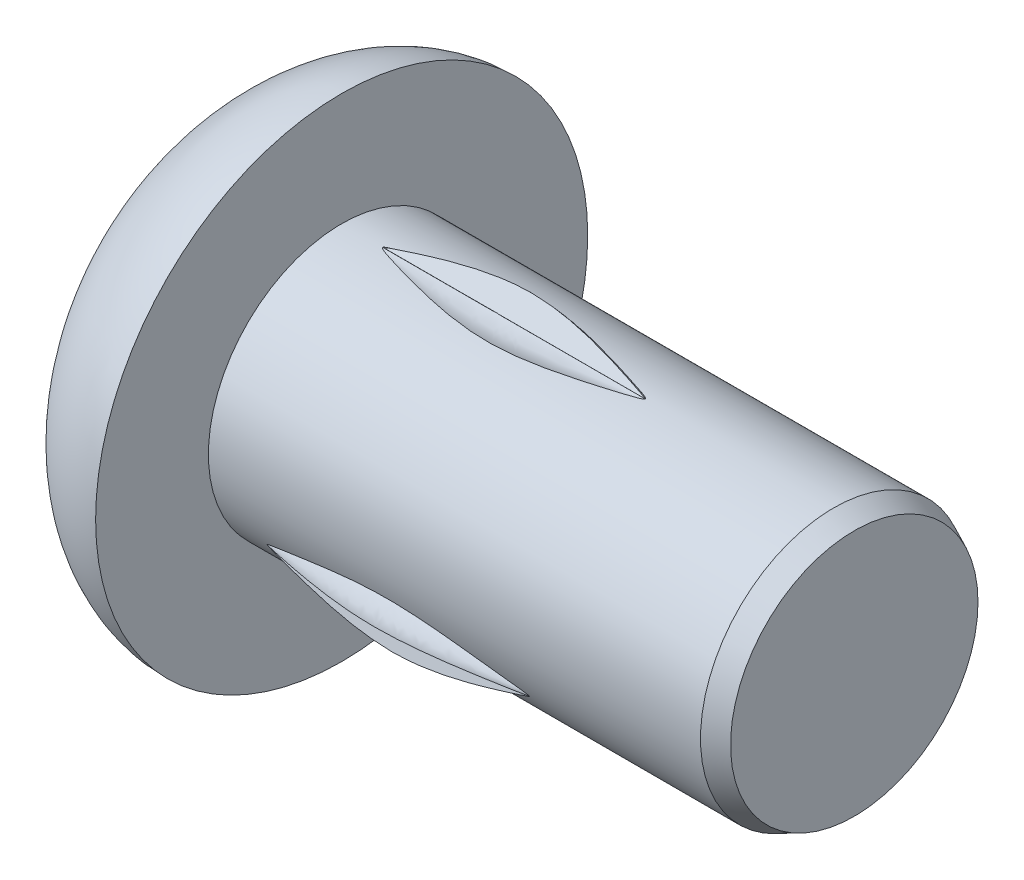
ISO-10303-21;
HEADER;
FILE_DESCRIPTION(('STEP AP214'),'2;1');
FILE_NAME('part.step','',(''),(''),'','','');
FILE_SCHEMA(('AUTOMOTIVE_DESIGN { 1 0 10303 214 1 1 1 1 }'));
ENDSEC;
DATA;
#1=APPLICATION_CONTEXT('core data for automotive mechanical design processes');
#2=APPLICATION_PROTOCOL_DEFINITION('international standard','automotive_design',2000,#1);
#3=PRODUCT_CONTEXT('',#1,'mechanical');
#4=PRODUCT('Part','Part','',(#3));
#5=PRODUCT_RELATED_PRODUCT_CATEGORY('part','',(#4));
#6=PRODUCT_DEFINITION_FORMATION('','',#4);
#7=PRODUCT_DEFINITION_CONTEXT('part definition',#1,'design');
#8=PRODUCT_DEFINITION('design','',#6,#7);
#9=PRODUCT_DEFINITION_SHAPE('','',#8);
#10=(LENGTH_UNIT() NAMED_UNIT(*) SI_UNIT(.MILLI.,.METRE.));
#11=(NAMED_UNIT(*) PLANE_ANGLE_UNIT() SI_UNIT($,.RADIAN.));
#12=(NAMED_UNIT(*) SI_UNIT($,.STERADIAN.) SOLID_ANGLE_UNIT());
#13=UNCERTAINTY_MEASURE_WITH_UNIT(LENGTH_MEASURE(1.E-05),#10,'distance_accuracy_value','');
#14=(GEOMETRIC_REPRESENTATION_CONTEXT(3) GLOBAL_UNCERTAINTY_ASSIGNED_CONTEXT((#13)) GLOBAL_UNIT_ASSIGNED_CONTEXT((#10,
#11,#12)) REPRESENTATION_CONTEXT('',''));
#15=CARTESIAN_POINT('',(0.,0.,0.));
#16=DIRECTION('',(0.,0.,1.));
#17=DIRECTION('',(1.,0.,0.));
#18=AXIS2_PLACEMENT_3D('',#15,#16,#17);
#19=CARTESIAN_POINT('',(0.254,-0.396576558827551,0.685568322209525));
#20=CARTESIAN_POINT('',(0.524933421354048,-0.361395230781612,0.620268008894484));
#21=CARTESIAN_POINT('',(1.06680061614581,-0.29103252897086,0.489667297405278));
#22=CARTESIAN_POINT('',(1.60866675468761,-0.361574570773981,0.620175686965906));
#23=CARTESIAN_POINT('',(1.8796,-0.396845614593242,0.68542992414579));
#24=CARTESIAN_POINT('',(0.254,-0.392694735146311,0.687609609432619));
#25=CARTESIAN_POINT('',(0.524933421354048,-0.340417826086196,0.631519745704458));
#26=CARTESIAN_POINT('',(1.06680061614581,-0.235863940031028,0.519339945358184));
#27=CARTESIAN_POINT('',(1.60866675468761,-0.340572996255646,0.631380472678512));
#28=CARTESIAN_POINT('',(1.8796,-0.392927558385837,0.687400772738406));
#29=CARTESIAN_POINT('',(0.254,-0.387055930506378,0.695244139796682));
#30=CARTESIAN_POINT('',(0.524933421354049,-0.308064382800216,0.671410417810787));
#31=CARTESIAN_POINT('',(1.06680061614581,-0.150081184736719,0.623742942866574));
#32=CARTESIAN_POINT('',(1.60866675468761,-0.308128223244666,0.671202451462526));
#33=CARTESIAN_POINT('',(1.8796,-0.387151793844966,0.694932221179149));
#34=CARTESIAN_POINT('',(0.254,-0.387443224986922,0.709212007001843));
#35=CARTESIAN_POINT('',(0.524933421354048,-0.315278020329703,0.748160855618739));
#36=CARTESIAN_POINT('',(1.0668006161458,-0.170947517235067,0.826058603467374));
#37=CARTESIAN_POINT('',(1.60866675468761,-0.315173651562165,0.74795608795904));
#38=CARTESIAN_POINT('',(1.8796,-0.387286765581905,0.708904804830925));
#39=CARTESIAN_POINT('',(0.254,-0.399146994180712,0.717556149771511));
#40=CARTESIAN_POINT('',(0.524933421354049,-0.37537977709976,0.79661542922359));
#41=CARTESIAN_POINT('',(1.06680061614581,-0.327845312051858,0.954734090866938));
#42=CARTESIAN_POINT('',(1.60866675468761,-0.375173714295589,0.796550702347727));
#43=CARTESIAN_POINT('',(1.8796,-0.398837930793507,0.717458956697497));
#44=CARTESIAN_POINT('',(0.254,-0.413408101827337,0.717342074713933));
#45=CARTESIAN_POINT('',(0.524933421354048,-0.452230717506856,0.78950720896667));
#46=CARTESIAN_POINT('',(1.06680061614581,-0.529875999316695,0.933837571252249));
#47=CARTESIAN_POINT('',(1.60866675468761,-0.452025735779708,0.789614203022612));
#48=CARTESIAN_POINT('',(1.8796,-0.413100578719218,0.717502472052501));
#49=CARTESIAN_POINT('',(0.254,-0.421467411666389,0.705635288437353));
#50=CARTESIAN_POINT('',(0.524933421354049,-0.500566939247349,0.72937327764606));
#51=CARTESIAN_POINT('',(1.06680061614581,-0.658766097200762,0.776849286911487));
#52=CARTESIAN_POINT('',(1.60866675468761,-0.500502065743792,0.729578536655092));
#53=CARTESIAN_POINT('',(1.8796,-0.421369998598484,0.705943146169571));
#54=CARTESIAN_POINT('',(0.254,-0.421045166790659,0.691289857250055));
#55=CARTESIAN_POINT('',(0.524933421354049,-0.493357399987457,0.652519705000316));
#56=CARTESIAN_POINT('',(1.06680061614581,-0.637981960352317,0.574979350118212));
#57=CARTESIAN_POINT('',(1.60866675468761,-0.493465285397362,0.652721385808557));
#58=CARTESIAN_POINT('',(1.8796,-0.421206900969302,0.691592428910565));
#59=CARTESIAN_POINT('',(0.254,-0.409861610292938,0.68315984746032));
#60=CARTESIAN_POINT('',(0.524933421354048,-0.433456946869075,0.604105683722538));
#61=CARTESIAN_POINT('',(1.06680061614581,-0.480647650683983,0.44599725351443));
#62=CARTESIAN_POINT('',(1.60866675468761,-0.433663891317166,0.604173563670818));
#63=CARTESIAN_POINT('',(1.8796,-0.410171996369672,0.683261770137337));
#64=CARTESIAN_POINT('',(0.254,-0.400458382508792,0.68352703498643));
#65=CARTESIAN_POINT('',(0.524933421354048,-0.382372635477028,0.60901627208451));
#66=CARTESIAN_POINT('',(1.06680061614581,-0.346201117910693,0.459994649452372));
#67=CARTESIAN_POINT('',(1.60866675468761,-0.382576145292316,0.6089709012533));
#68=CARTESIAN_POINT('',(1.8796,-0.400763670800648,0.683459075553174));
#69=CARTESIAN_POINT('',(0.254,-0.396576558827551,0.685568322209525));
#70=CARTESIAN_POINT('',(0.524933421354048,-0.361395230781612,0.620268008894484));
#71=CARTESIAN_POINT('',(1.06680061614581,-0.29103252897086,0.489667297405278));
#72=CARTESIAN_POINT('',(1.60866675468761,-0.361574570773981,0.620175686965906));
#73=CARTESIAN_POINT('',(1.8796,-0.396845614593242,0.68542992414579));
#74=B_SPLINE_SURFACE_WITH_KNOTS('',3,3,((#19,#20,#21,#22,#23),(#24,#25,#26,#27,#28),(#29,#30,
#31,#32,#33),(#34,#35,#36,#37,#38),(#39,#40,#41,#42,#43),(#44,#45,#46,#47,#48),(#49,#50,#51,#52,
#53),(#54,#55,#56,#57,#58),(#59,#60,#61,#62,#63),(#64,#65,#66,#67,#68),(#69,#70,#71,#72,#73)),
.UNSPECIFIED.,.T.,.F.,.F.,(4,1,1,1,1,1,1,1,4),(4,1,4),(0.,0.125,0.25,0.375,0.5,0.625,0.75,0.875,
1.),(0.,0.49999967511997,1.),.UNSPECIFIED.);
#75=CARTESIAN_POINT('',(0.254,-0.41265072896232,0.715274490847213));
#76=CARTESIAN_POINT('',(0.258024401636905,-0.412259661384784,0.716733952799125));
#77=CARTESIAN_POINT('',(0.262083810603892,-0.411895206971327,0.718094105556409));
#78=CARTESIAN_POINT('',(0.270241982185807,-0.411197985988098,0.720696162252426));
#79=CARTESIAN_POINT('',(0.274340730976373,-0.410865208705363,0.721938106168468));
#80=CARTESIAN_POINT('',(0.294846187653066,-0.409227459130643,0.728050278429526));
#81=CARTESIAN_POINT('',(0.311338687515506,-0.407996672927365,0.732643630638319));
#82=CARTESIAN_POINT('',(0.344374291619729,-0.405571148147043,0.74169580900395));
#83=CARTESIAN_POINT('',(0.360917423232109,-0.404376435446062,0.746154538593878));
#84=CARTESIAN_POINT('',(0.410655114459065,-0.400838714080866,0.759357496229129));
#85=CARTESIAN_POINT('',(0.443904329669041,-0.398546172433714,0.767913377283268));
#86=CARTESIAN_POINT('',(0.51056244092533,-0.39412277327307,0.784421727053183));
#87=CARTESIAN_POINT('',(0.543971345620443,-0.391991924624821,0.792374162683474));
#88=CARTESIAN_POINT('',(0.644409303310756,-0.385947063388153,0.814933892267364));
#89=CARTESIAN_POINT('',(0.71176477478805,-0.382372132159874,0.828275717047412));
#90=CARTESIAN_POINT('',(0.824980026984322,-0.377678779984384,0.845791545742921));
#91=CARTESIAN_POINT('',(0.8705677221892,-0.376138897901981,0.851538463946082));
#92=CARTESIAN_POINT('',(0.962224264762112,-0.373944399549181,0.859728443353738));
#93=CARTESIAN_POINT('',(1.00829428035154,-0.373293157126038,0.862158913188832));
#94=CARTESIAN_POINT('',(1.05445263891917,-0.373195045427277,0.862525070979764));
#95=B_SPLINE_CURVE_WITH_KNOTS('',3,(#75,#76,#77,#78,#79,#80,#81,#82,#83,#84,#85,#86,#87,#88,#89,
#90,#91,#92,#93,#94),.UNSPECIFIED.,.F.,.F.,(4,2,2,2,2,2,2,2,2,4),(0.,0.0128900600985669,
0.025775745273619,0.0772652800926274,0.12879091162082,0.232009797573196,0.335234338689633,
0.541324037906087,0.67913005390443,0.817457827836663),.UNSPECIFIED.);
#96=CARTESIAN_POINT('',(0.254,-0.412054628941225,0.715401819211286));
#97=VERTEX_POINT('',#96);
#98=CARTESIAN_POINT('',(1.05445263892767,-0.373195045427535,0.862525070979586));
#99=VERTEX_POINT('',#98);
#100=EDGE_CURVE('E90',#97,#99,#95,.T.);
#101=CARTESIAN_POINT('',(1.05445263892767,-0.373195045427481,0.862525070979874));
#102=CARTESIAN_POINT('',(1.05547997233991,-0.373303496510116,0.862554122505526));
#103=CARTESIAN_POINT('',(1.05650882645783,-0.373398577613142,0.862579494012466));
#104=CARTESIAN_POINT('',(1.05856653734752,-0.373561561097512,0.862622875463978));
#105=CARTESIAN_POINT('',(1.05959538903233,-0.373629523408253,0.862640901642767));
#106=CARTESIAN_POINT('',(1.0616530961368,-0.373738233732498,0.862669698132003));
#107=CARTESIAN_POINT('',(1.06268194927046,-0.373779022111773,0.862680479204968));
#108=CARTESIAN_POINT('',(1.06473965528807,-0.37383338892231,0.862694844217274));
#109=CARTESIAN_POINT('',(1.06576850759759,-0.373846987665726,0.862698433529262));
#110=CARTESIAN_POINT('',(1.0678262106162,-0.373846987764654,0.862698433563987));
#111=CARTESIAN_POINT('',(1.06885506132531,-0.373833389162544,0.86269484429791));
#112=CARTESIAN_POINT('',(1.07091276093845,-0.373779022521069,0.862680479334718));
#113=CARTESIAN_POINT('',(1.07194160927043,-0.373738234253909,0.86266969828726));
#114=CARTESIAN_POINT('',(1.07399930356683,-0.373629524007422,0.862640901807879));
#115=CARTESIAN_POINT('',(1.07502814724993,-0.373561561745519,0.862622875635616));
#116=CARTESIAN_POINT('',(1.07708583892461,-0.373398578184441,0.862579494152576));
#117=CARTESIAN_POINT('',(1.07811468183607,-0.373303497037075,0.862554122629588));
#118=CARTESIAN_POINT('',(1.07914200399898,-0.373195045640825,0.862525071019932));
#119=B_SPLINE_CURVE_WITH_KNOTS('',3,(#101,#102,#103,#104,#105,#106,#107,#108,#109,#110,#111,
#112,#113,#114,#115,#116,#117,#118),.UNSPECIFIED.,.F.,.F.,(4,2,2,2,2,2,2,2,4),(0.,
0.00310026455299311,0.00619363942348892,0.00928240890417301,0.0123688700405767,
0.0154553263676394,0.0185440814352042,0.0216374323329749,0.0247376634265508),.UNSPECIFIED.);
#120=CARTESIAN_POINT('',(1.07914200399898,-0.373195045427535,0.862525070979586));
#121=VERTEX_POINT('',#120);
#122=EDGE_CURVE('E12',#99,#121,#119,.T.);
#123=CARTESIAN_POINT('',(1.0791420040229,-0.373195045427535,0.862525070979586));
#124=CARTESIAN_POINT('',(1.10617308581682,-0.373252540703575,0.862310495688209));
#125=CARTESIAN_POINT('',(1.1331876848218,-0.373500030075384,0.861386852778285));
#126=CARTESIAN_POINT('',(1.214256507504,-0.374751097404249,0.856717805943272));
#127=CARTESIAN_POINT('',(1.26820021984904,-0.376264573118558,0.851069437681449));
#128=CARTESIAN_POINT('',(1.37559320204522,-0.380312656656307,0.835961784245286));
#129=CARTESIAN_POINT('',(1.42904104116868,-0.382849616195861,0.826493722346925));
#130=CARTESIAN_POINT('',(1.51580354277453,-0.387562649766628,0.808904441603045));
#131=CARTESIAN_POINT('',(1.54929444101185,-0.389528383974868,0.801568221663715));
#132=CARTESIAN_POINT('',(1.61608482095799,-0.393669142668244,0.786114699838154));
#133=CARTESIAN_POINT('',(1.64938428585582,-0.395844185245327,0.777997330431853));
#134=CARTESIAN_POINT('',(1.69912743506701,-0.399213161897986,0.765424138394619));
#135=CARTESIAN_POINT('',(1.71562906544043,-0.400350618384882,0.761179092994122));
#136=CARTESIAN_POINT('',(1.74859736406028,-0.402658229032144,0.752566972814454));
#137=CARTESIAN_POINT('',(1.76506403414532,-0.403828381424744,0.748199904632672));
#138=CARTESIAN_POINT('',(1.78973355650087,-0.405610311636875,0.741549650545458));
#139=CARTESIAN_POINT('',(1.79795090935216,-0.406208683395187,0.739316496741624));
#140=CARTESIAN_POINT('',(1.81437239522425,-0.407416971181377,0.734807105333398));
#141=CARTESIAN_POINT('',(1.82257652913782,-0.408026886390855,0.732530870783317));
#142=CARTESIAN_POINT('',(1.83896474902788,-0.409265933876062,0.727906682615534));
#143=CARTESIAN_POINT('',(1.84714883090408,-0.409895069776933,0.725558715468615));
#144=CARTESIAN_POINT('',(1.85938787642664,-0.410871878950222,0.721913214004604));
#145=CARTESIAN_POINT('',(1.86346183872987,-0.411203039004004,0.720677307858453));
#146=CARTESIAN_POINT('',(1.87156907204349,-0.41189784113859,0.718084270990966));
#147=CARTESIAN_POINT('',(1.87560233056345,-0.412261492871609,0.716727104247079));
#148=CARTESIAN_POINT('',(1.87960000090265,-0.412652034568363,0.715269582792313));
#149=B_SPLINE_CURVE_WITH_KNOTS('',3,(#123,#124,#125,#126,#127,#128,#129,#130,#131,#132,#133,
#134,#135,#136,#137,#138,#139,#140,#141,#142,#143,#144,#145,#146,#147,#148),.UNSPECIFIED.,.F.,
.F.,(4,2,2,2,2,2,2,2,2,2,2,2,4),(0.,0.0810716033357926,0.24361991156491,0.406543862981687,
0.509557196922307,0.612579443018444,0.663809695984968,0.715037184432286,0.740646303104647,
0.766253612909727,0.79186578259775,0.80467477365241,0.817487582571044),.UNSPECIFIED.);
#150=CARTESIAN_POINT('',(1.8796,-0.412656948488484,0.715010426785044));
#151=VERTEX_POINT('',#150);
#152=EDGE_CURVE('E257',#121,#151,#149,.T.);
#153=CARTESIAN_POINT('',(1.8796,-0.410270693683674,0.716329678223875));
#154=CARTESIAN_POINT('',(1.87882627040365,-0.409435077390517,0.716807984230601));
#155=CARTESIAN_POINT('',(1.87793495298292,-0.408715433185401,0.717218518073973));
#156=CARTESIAN_POINT('',(1.87602674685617,-0.407426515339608,0.717951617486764));
#157=CARTESIAN_POINT('',(1.87501117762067,-0.406855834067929,0.718275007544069));
#158=CARTESIAN_POINT('',(1.87050957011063,-0.404490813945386,0.719612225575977));
#159=CARTESIAN_POINT('',(1.86684332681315,-0.402983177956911,0.720456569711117));
#160=CARTESIAN_POINT('',(1.85937295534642,-0.400132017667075,0.722043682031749));
#161=CARTESIAN_POINT('',(1.85556760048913,-0.398791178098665,0.722784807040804));
#162=CARTESIAN_POINT('',(1.84414941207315,-0.394953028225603,0.724893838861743));
#163=CARTESIAN_POINT('',(1.83646511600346,-0.392612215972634,0.726163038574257));
#164=CARTESIAN_POINT('',(1.82103363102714,-0.388085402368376,0.728592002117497));
#165=CARTESIAN_POINT('',(1.81328640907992,-0.385899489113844,0.729751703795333));
#166=CARTESIAN_POINT('',(1.79012248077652,-0.379508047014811,0.733107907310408));
#167=CARTESIAN_POINT('',(1.77465530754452,-0.375430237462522,0.735202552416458));
#168=CARTESIAN_POINT('',(1.72810773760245,-0.363394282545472,0.74126588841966));
#169=CARTESIAN_POINT('',(1.69694342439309,-0.355650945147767,0.745004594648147));
#170=CARTESIAN_POINT('',(1.6344456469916,-0.340625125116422,0.751992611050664));
#171=CARTESIAN_POINT('',(1.60311216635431,-0.333342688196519,0.755241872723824));
#172=CARTESIAN_POINT('',(1.54014401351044,-0.319390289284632,0.761247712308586));
#173=CARTESIAN_POINT('',(1.50850867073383,-0.312722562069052,0.764002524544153));
#174=CARTESIAN_POINT('',(1.44501299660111,-0.300257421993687,0.768986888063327));
#175=CARTESIAN_POINT('',(1.41315258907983,-0.294460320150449,0.771216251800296));
#176=CARTESIAN_POINT('',(1.33227481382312,-0.281240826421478,0.776161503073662));
#177=CARTESIAN_POINT('',(1.28310432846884,-0.274582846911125,0.778510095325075));
#178=CARTESIAN_POINT('',(1.18435888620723,-0.264971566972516,0.781836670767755));
#179=CARTESIAN_POINT('',(1.13478429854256,-0.262015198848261,0.782815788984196));
#180=CARTESIAN_POINT('',(1.06043422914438,-0.261151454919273,0.783102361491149));
#181=CARTESIAN_POINT('',(1.03567686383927,-0.261456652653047,0.783001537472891));
#182=CARTESIAN_POINT('',(0.986204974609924,-0.263189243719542,0.782420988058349));
#183=CARTESIAN_POINT('',(0.961490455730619,-0.264616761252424,0.781941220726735));
#184=CARTESIAN_POINT('',(0.887456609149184,-0.27037946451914,0.779975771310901));
#185=CARTESIAN_POINT('',(0.838264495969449,-0.276194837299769,0.77796390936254));
#186=CARTESIAN_POINT('',(0.746690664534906,-0.28980560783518,0.772986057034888));
#187=CARTESIAN_POINT('',(0.704244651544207,-0.297251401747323,0.770175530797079));
#188=CARTESIAN_POINT('',(0.619720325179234,-0.31370925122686,0.763619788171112));
#189=CARTESIAN_POINT('',(0.577642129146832,-0.322721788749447,0.759874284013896));
#190=CARTESIAN_POINT('',(0.511093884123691,-0.337853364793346,0.753221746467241));
#191=CARTESIAN_POINT('',(0.48651522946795,-0.343633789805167,0.750605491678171));
#192=CARTESIAN_POINT('',(0.437470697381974,-0.355478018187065,0.74506949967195));
#193=CARTESIAN_POINT('',(0.413004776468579,-0.361541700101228,0.742149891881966));
#194=CARTESIAN_POINT('',(0.376242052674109,-0.370932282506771,0.737476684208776));
#195=CARTESIAN_POINT('',(0.36389563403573,-0.374133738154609,0.735858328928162));
#196=CARTESIAN_POINT('',(0.339253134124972,-0.380667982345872,0.73249972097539));
#197=CARTESIAN_POINT('',(0.326957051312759,-0.384000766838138,0.730759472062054));
#198=CARTESIAN_POINT('',(0.308804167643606,-0.389173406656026,0.728009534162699));
#199=CARTESIAN_POINT('',(0.302900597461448,-0.390895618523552,0.727086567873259));
#200=CARTESIAN_POINT('',(0.291154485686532,-0.394463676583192,0.725157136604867));
#201=CARTESIAN_POINT('',(0.285311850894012,-0.396309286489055,0.724150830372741));
#202=CARTESIAN_POINT('',(0.276754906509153,-0.399250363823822,0.722530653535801));
#203=CARTESIAN_POINT('',(0.273990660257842,-0.400238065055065,0.721984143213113));
#204=CARTESIAN_POINT('',(0.268515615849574,-0.40231764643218,0.72082746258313));
#205=CARTESIAN_POINT('',(0.265804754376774,-0.403409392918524,0.720217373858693));
#206=CARTESIAN_POINT('',(0.261908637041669,-0.405189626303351,0.719216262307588));
#207=CARTESIAN_POINT('',(0.260669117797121,-0.40578919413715,0.718878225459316));
#208=CARTESIAN_POINT('',(0.25826042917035,-0.407073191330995,0.718151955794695));
#209=CARTESIAN_POINT('',(0.257090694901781,-0.407756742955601,0.71776424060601));
#210=CARTESIAN_POINT('',(0.25564307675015,-0.40880336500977,0.717168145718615));
#211=CARTESIAN_POINT('',(0.255285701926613,-0.409080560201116,0.717010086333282));
#212=CARTESIAN_POINT('',(0.254608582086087,-0.40967116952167,0.716672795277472));
#213=CARTESIAN_POINT('',(0.254289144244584,-0.409984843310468,0.716493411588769));
#214=CARTESIAN_POINT('',(0.254,-0.410321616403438,0.716300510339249));
#215=B_SPLINE_CURVE_WITH_KNOTS('',3,(#153,#154,#155,#156,#157,#158,#159,#160,#161,#162,#163,
#164,#165,#166,#167,#168,#169,#170,#171,#172,#173,#174,#175,#176,#177,#178,#179,#180,#181,#182,
#183,#184,#185,#186,#187,#188,#189,#190,#191,#192,#193,#194,#195,#196,#197,#198,#199,#200,#201,
#202,#203,#204,#205,#206,#207,#208,#209,#210,#211,#212,#213,#214),.UNSPECIFIED.,.F.,.F.,(4,2,2,
2,2,2,2,2,2,2,2,2,2,2,2,2,2,2,2,2,2,2,2,2,2,2,2,2,2,2,4),(0.,0.00364937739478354,
0.00726290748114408,0.0193946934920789,0.0317016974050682,0.0560870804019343,0.0804862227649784,
0.128878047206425,0.225857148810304,0.322845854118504,0.420174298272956,0.517537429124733,
0.666447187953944,0.815233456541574,0.889482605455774,0.963739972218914,1.1123070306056,
1.24181976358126,1.37137240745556,1.44752333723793,1.52364190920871,1.56221275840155,
1.60078241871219,1.61943783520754,1.63805849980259,1.64701576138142,1.65596166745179,
1.66021437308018,1.66442590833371,1.66586045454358,1.66730592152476),.UNSPECIFIED.);
#216=EDGE_CURVE('E362',#151,#97,#215,.T.);
#217=ORIENTED_EDGE('',*,*,#100,.T.);
#218=ORIENTED_EDGE('',*,*,#122,.T.);
#219=ORIENTED_EDGE('',*,*,#152,.T.);
#220=ORIENTED_EDGE('',*,*,#216,.T.);
#221=EDGE_LOOP('',(#217,#218,#219,#220));
#222=FACE_BOUND('',#221,.T.);
#223=ADVANCED_FACE('F71',(#222),#74,.T.);
#224=CARTESIAN_POINT('',(0.254,-0.414899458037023,0.713658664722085));
#225=CARTESIAN_POINT('',(0.254790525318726,-0.41576715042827,0.713153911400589));
#226=CARTESIAN_POINT('',(0.255704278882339,-0.416514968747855,0.712717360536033));
#227=CARTESIAN_POINT('',(0.257663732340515,-0.417853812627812,0.711933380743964));
#228=CARTESIAN_POINT('',(0.258707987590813,-0.418446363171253,0.711585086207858));
#229=CARTESIAN_POINT('',(0.26332925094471,-0.420892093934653,0.710144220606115));
#230=CARTESIAN_POINT('',(0.267099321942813,-0.422440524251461,0.709223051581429));
#231=CARTESIAN_POINT('',(0.274790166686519,-0.425350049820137,0.707481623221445));
#232=CARTESIAN_POINT('',(0.278712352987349,-0.426707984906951,0.706663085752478));
#233=CARTESIAN_POINT('',(0.290479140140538,-0.430575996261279,0.70431800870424));
#234=CARTESIAN_POINT('',(0.298400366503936,-0.432910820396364,0.702883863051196));
#235=CARTESIAN_POINT('',(0.31430776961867,-0.437401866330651,0.700097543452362));
#236=CARTESIAN_POINT('',(0.322293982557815,-0.439557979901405,0.698745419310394));
#237=CARTESIAN_POINT('',(0.338236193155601,-0.443740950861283,0.69609650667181));
#238=CARTESIAN_POINT('',(0.346191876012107,-0.445768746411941,0.69479934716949));
#239=CARTESIAN_POINT('',(0.362122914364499,-0.449749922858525,0.692228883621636));
#240=CARTESIAN_POINT('',(0.370098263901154,-0.451703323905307,0.69095557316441));
#241=CARTESIAN_POINT('',(0.410089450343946,-0.461352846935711,0.684609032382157));
#242=CARTESIAN_POINT('',(0.442220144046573,-0.468639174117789,0.679632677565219));
#243=CARTESIAN_POINT('',(0.506659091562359,-0.482519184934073,0.669848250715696));
#244=CARTESIAN_POINT('',(0.53896736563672,-0.489112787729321,0.665040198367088));
#245=CARTESIAN_POINT('',(0.603900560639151,-0.501504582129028,0.655746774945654));
#246=CARTESIAN_POINT('',(0.636526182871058,-0.507300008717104,0.651262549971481));
#247=CARTESIAN_POINT('',(0.702017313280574,-0.517925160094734,0.642845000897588));
#248=CARTESIAN_POINT('',(0.734882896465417,-0.522754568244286,0.63891185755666));
#249=CARTESIAN_POINT('',(0.816065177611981,-0.533239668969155,0.630215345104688));
#250=CARTESIAN_POINT('',(0.864519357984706,-0.53824971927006,0.625905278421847));
#251=CARTESIAN_POINT('',(0.961796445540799,-0.545269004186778,0.619802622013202));
#252=CARTESIAN_POINT('',(1.01061902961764,-0.547280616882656,0.61800803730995));
#253=CARTESIAN_POINT('',(1.10819744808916,-0.547629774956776,0.61769914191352));
#254=CARTESIAN_POINT('',(1.15695323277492,-0.545974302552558,0.619178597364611));
#255=CARTESIAN_POINT('',(1.25411474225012,-0.539598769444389,0.62473944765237));
#256=CARTESIAN_POINT('',(1.30252020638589,-0.534876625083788,0.62882261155));
#257=CARTESIAN_POINT('',(1.39225193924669,-0.523773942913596,0.638087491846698));
#258=CARTESIAN_POINT('',(1.43364290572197,-0.51770762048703,0.643043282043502));
#259=CARTESIAN_POINT('',(1.51606909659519,-0.504067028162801,0.653790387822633));
#260=CARTESIAN_POINT('',(1.55710425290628,-0.496492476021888,0.659581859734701));
#261=CARTESIAN_POINT('',(1.62215031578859,-0.483464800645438,0.669139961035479));
#262=CARTESIAN_POINT('',(1.64626368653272,-0.478410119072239,0.672766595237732));
#263=CARTESIAN_POINT('',(1.69438225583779,-0.46790968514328,0.680111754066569));
#264=CARTESIAN_POINT('',(1.71838749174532,-0.462464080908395,0.683830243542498));
#265=CARTESIAN_POINT('',(1.75467835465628,-0.45385912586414,0.689546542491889));
#266=CARTESIAN_POINT('',(1.76701063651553,-0.450869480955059,0.691505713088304));
#267=CARTESIAN_POINT('',(1.79162507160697,-0.444722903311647,0.695474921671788));
#268=CARTESIAN_POINT('',(1.80390723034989,-0.441565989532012,0.697484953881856));
#269=CARTESIAN_POINT('',(1.82217253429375,-0.436598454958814,0.700596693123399));
#270=CARTESIAN_POINT('',(1.82819954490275,-0.434914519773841,0.701643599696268));
#271=CARTESIAN_POINT('',(1.84019366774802,-0.431413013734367,0.703802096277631));
#272=CARTESIAN_POINT('',(1.84616086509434,-0.429595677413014,0.704913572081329));
#273=CARTESIAN_POINT('',(1.8549672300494,-0.426669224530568,0.706685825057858));
#274=CARTESIAN_POINT('',(1.85785449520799,-0.425669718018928,0.707288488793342));
#275=CARTESIAN_POINT('',(1.86358864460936,-0.423553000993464,0.708558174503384));
#276=CARTESIAN_POINT('',(1.86643531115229,-0.422435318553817,0.709225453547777));
#277=CARTESIAN_POINT('',(1.87057483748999,-0.420597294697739,0.710315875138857));
#278=CARTESIAN_POINT('',(1.87191954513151,-0.419965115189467,0.71068991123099));
#279=CARTESIAN_POINT('',(1.87453695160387,-0.418612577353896,0.711487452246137));
#280=CARTESIAN_POINT('',(1.87581018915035,-0.417893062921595,0.711910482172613));
#281=CARTESIAN_POINT('',(1.87747921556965,-0.416747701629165,0.712581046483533));
#282=CARTESIAN_POINT('',(1.8779453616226,-0.416402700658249,0.712782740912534));
#283=CARTESIAN_POINT('',(1.8788231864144,-0.415658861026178,0.713216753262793));
#284=CARTESIAN_POINT('',(1.87923435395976,-0.415259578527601,0.713449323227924));
#285=CARTESIAN_POINT('',(1.8796,-0.414824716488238,0.71370211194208));
#286=B_SPLINE_CURVE_WITH_KNOTS('',3,(#224,#225,#226,#227,#228,#229,#230,#231,#232,#233,#234,
#235,#236,#237,#238,#239,#240,#241,#242,#243,#244,#245,#246,#247,#248,#249,#250,#251,#252,#253,
#254,#255,#256,#257,#258,#259,#260,#261,#262,#263,#264,#265,#266,#267,#268,#269,#270,#271,#272,
#273,#274,#275,#276,#277,#278,#279,#280,#281,#282,#283,#284,#285),.UNSPECIFIED.,.F.,.F.,(4,2,2,
2,2,2,2,2,2,2,2,2,2,2,2,2,2,2,2,2,2,2,2,2,2,2,2,2,2,2,4),(0.,0.00377500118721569,
0.0075114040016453,0.0200157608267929,0.0327077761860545,0.0578395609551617,0.082986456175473,
0.107920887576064,0.132848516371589,0.232797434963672,0.332758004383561,0.433056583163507,
0.533387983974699,0.67997793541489,0.826451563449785,0.97264654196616,1.11894095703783,
1.24527310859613,1.37162892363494,1.44633538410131,1.52101368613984,1.55953300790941,
1.59804797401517,1.61708215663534,1.6360836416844,1.64542575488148,1.65480669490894,
1.65940213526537,1.66395625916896,1.66579379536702,1.66764737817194),.UNSPECIFIED.);
#287=EDGE_CURVE('E361',#97,#151,#286,.T.);
#288=CARTESIAN_POINT('',(1.8796,-0.41310125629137,0.714998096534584));
#289=CARTESIAN_POINT('',(1.8754062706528,-0.414580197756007,0.715394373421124));
#290=CARTESIAN_POINT('',(1.87118173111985,-0.415970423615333,0.715766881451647));
#291=CARTESIAN_POINT('',(1.86269760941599,-0.418643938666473,0.71648324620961));
#292=CARTESIAN_POINT('',(1.85843803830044,-0.419927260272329,0.716827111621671));
#293=CARTESIAN_POINT('',(1.83712557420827,-0.426250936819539,0.718521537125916));
#294=CARTESIAN_POINT('',(1.8199899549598,-0.43102451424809,0.719800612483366));
#295=CARTESIAN_POINT('',(1.78566549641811,-0.440426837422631,0.722319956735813));
#296=CARTESIAN_POINT('',(1.76847662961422,-0.445055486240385,0.723560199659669));
#297=CARTESIAN_POINT('',(1.71678603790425,-0.458755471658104,0.727231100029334));
#298=CARTESIAN_POINT('',(1.68222500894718,-0.467622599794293,0.729607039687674));
#299=CARTESIAN_POINT('',(1.61292332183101,-0.484681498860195,0.734177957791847));
#300=CARTESIAN_POINT('',(1.57818264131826,-0.492873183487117,0.736372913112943));
#301=CARTESIAN_POINT('',(1.47372149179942,-0.51599109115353,0.742567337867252));
#302=CARTESIAN_POINT('',(1.40363504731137,-0.529495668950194,0.746185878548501));
#303=CARTESIAN_POINT('',(1.29160431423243,-0.545822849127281,0.750560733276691));
#304=CARTESIAN_POINT('',(1.25000041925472,-0.550753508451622,0.751881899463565));
#305=CARTESIAN_POINT('',(1.16647176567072,-0.557817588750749,0.753774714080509));
#306=CARTESIAN_POINT('',(1.12454657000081,-0.559946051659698,0.75434503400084));
#307=CARTESIAN_POINT('',(1.08255278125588,-0.560371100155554,0.754458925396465));
#308=B_SPLINE_CURVE_WITH_KNOTS('',3,(#288,#289,#290,#291,#292,#293,#294,#295,#296,#297,#298,
#299,#300,#301,#302,#303,#304,#305,#306,#307),.UNSPECIFIED.,.F.,.F.,(4,2,2,2,2,2,2,2,2,4),(0.,
0.0133888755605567,0.0267736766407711,0.0802720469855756,0.133805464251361,0.241074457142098,
0.348357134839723,0.562526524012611,0.688182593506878,0.814060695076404),.UNSPECIFIED.);
#309=CARTESIAN_POINT('',(1.08255278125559,-0.560371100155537,0.754458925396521));
#310=VERTEX_POINT('',#309);
#311=EDGE_CURVE('E256',#151,#310,#308,.T.);
#312=CARTESIAN_POINT('',(1.08255278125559,-0.560371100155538,0.754458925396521));
#313=CARTESIAN_POINT('',(1.08124278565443,-0.560322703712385,0.754639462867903));
#314=CARTESIAN_POINT('',(1.07992950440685,-0.560279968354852,0.754797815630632));
#315=CARTESIAN_POINT('',(1.07730292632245,-0.560206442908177,0.755069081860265));
#316=CARTESIAN_POINT('',(1.07598964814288,-0.560175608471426,0.755182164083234));
#317=CARTESIAN_POINT('',(1.07336307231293,-0.560126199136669,0.755362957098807));
#318=CARTESIAN_POINT('',(1.07204978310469,-0.560107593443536,0.755430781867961));
#319=CARTESIAN_POINT('',(1.06942319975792,-0.560082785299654,0.755521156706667));
#320=CARTESIAN_POINT('',(1.06810990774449,-0.560076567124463,0.755543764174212));
#321=CARTESIAN_POINT('',(1.06548332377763,-0.560076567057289,0.755543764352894));
#322=CARTESIAN_POINT('',(1.0641700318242,-0.560082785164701,0.755521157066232));
#323=CARTESIAN_POINT('',(1.06154344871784,-0.560107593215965,0.755430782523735));
#324=CARTESIAN_POINT('',(1.06023015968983,-0.560126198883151,0.755362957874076));
#325=CARTESIAN_POINT('',(1.0576035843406,-0.560175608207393,0.75518216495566));
#326=CARTESIAN_POINT('',(1.05629030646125,-0.560206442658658,0.755069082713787));
#327=CARTESIAN_POINT('',(1.05366372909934,-0.560279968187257,0.75479781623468));
#328=CARTESIAN_POINT('',(1.0523504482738,-0.560322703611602,0.754639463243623));
#329=CARTESIAN_POINT('',(1.05104045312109,-0.560371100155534,0.754458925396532));
#330=B_SPLINE_CURVE_WITH_KNOTS('',3,(#312,#313,#314,#315,#316,#317,#318,#319,#320,#321,#322,
#323,#324,#325,#326,#327,#328,#329),.UNSPECIFIED.,.F.,.F.,(4,2,2,2,2,2,2,2,4),(0.,
0.00396961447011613,0.00792429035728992,0.0118689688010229,0.015808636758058,0.0197483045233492,
0.0236929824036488,0.0276476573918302,0.0316172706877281),.UNSPECIFIED.);
#331=CARTESIAN_POINT('',(1.05104045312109,-0.560371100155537,0.754458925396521));
#332=VERTEX_POINT('',#331);
#333=EDGE_CURVE('E225',#310,#332,#330,.T.);
#334=CARTESIAN_POINT('',(1.05104045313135,-0.560371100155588,0.754458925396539));
#335=CARTESIAN_POINT('',(1.02457079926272,-0.560102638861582,0.754386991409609));
#336=CARTESIAN_POINT('',(0.998118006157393,-0.559156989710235,0.754133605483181));
#337=CARTESIAN_POINT('',(0.918739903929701,-0.554503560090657,0.752886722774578));
#338=CARTESIAN_POINT('',(0.865922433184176,-0.548975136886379,0.751405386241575));
#339=CARTESIAN_POINT('',(0.760761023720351,-0.534249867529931,0.747459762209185));
#340=CARTESIAN_POINT('',(0.708418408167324,-0.525044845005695,0.744993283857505));
#341=CARTESIAN_POINT('',(0.622327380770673,-0.507718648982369,0.740350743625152));
#342=CARTESIAN_POINT('',(0.58841677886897,-0.500325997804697,0.738369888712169));
#343=CARTESIAN_POINT('',(0.520793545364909,-0.484728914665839,0.734190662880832));
#344=CARTESIAN_POINT('',(0.487080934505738,-0.476524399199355,0.731992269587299));
#345=CARTESIAN_POINT('',(0.436722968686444,-0.463803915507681,0.728583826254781));
#346=CARTESIAN_POINT('',(0.420017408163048,-0.459507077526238,0.727432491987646));
#347=CARTESIAN_POINT('',(0.386642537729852,-0.450786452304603,0.725095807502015));
#348=CARTESIAN_POINT('',(0.369973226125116,-0.446362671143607,0.723910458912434));
#349=CARTESIAN_POINT('',(0.345001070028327,-0.4396244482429,0.722104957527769));
#350=CARTESIAN_POINT('',(0.336683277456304,-0.437361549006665,0.721498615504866));
#351=CARTESIAN_POINT('',(0.320061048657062,-0.432791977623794,0.72027420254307));
#352=CARTESIAN_POINT('',(0.31175661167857,-0.430485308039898,0.719656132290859));
#353=CARTESIAN_POINT('',(0.295167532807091,-0.425801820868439,0.718401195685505));
#354=CARTESIAN_POINT('',(0.286882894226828,-0.423424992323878,0.717764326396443));
#355=CARTESIAN_POINT('',(0.274490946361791,-0.419744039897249,0.716778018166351));
#356=CARTESIAN_POINT('',(0.270365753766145,-0.418497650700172,0.716444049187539));
#357=CARTESIAN_POINT('',(0.262150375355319,-0.415899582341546,0.715747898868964));
#358=CARTESIAN_POINT('',(0.258060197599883,-0.414547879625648,0.715385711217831));
#359=CARTESIAN_POINT('',(0.254,-0.413110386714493,0.715000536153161));
#360=B_SPLINE_CURVE_WITH_KNOTS('',3,(#334,#335,#336,#337,#338,#339,#340,#341,#342,#343,#344,
#345,#346,#347,#348,#349,#350,#351,#352,#353,#354,#355,#356,#357,#358,#359),.UNSPECIFIED.,.F.,
.F.,(4,2,2,2,2,2,2,2,2,2,2,2,4),(0.,0.079391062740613,0.238554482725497,0.398073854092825,
0.502352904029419,0.6066426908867,0.658505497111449,0.710365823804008,0.736290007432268,
0.76221267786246,0.788139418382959,0.801105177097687,0.814073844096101),.UNSPECIFIED.);
#361=EDGE_CURVE('E94',#332,#97,#360,.T.);
#362=ORIENTED_EDGE('',*,*,#287,.T.);
#363=ORIENTED_EDGE('',*,*,#311,.T.);
#364=ORIENTED_EDGE('',*,*,#333,.T.);
#365=ORIENTED_EDGE('',*,*,#361,.T.);
#366=EDGE_LOOP('',(#362,#363,#364,#365));
#367=FACE_BOUND('',#366,.T.);
#368=ADVANCED_FACE('F261',(#367),#74,.T.);
#369=CARTESIAN_POINT('',(0.254,-0.395431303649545,-0.686229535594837));
#370=CARTESIAN_POINT('',(0.524933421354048,-0.356470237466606,-0.62311145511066));
#371=CARTESIAN_POINT('',(1.06680061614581,-0.278548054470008,-0.496875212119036));
#372=CARTESIAN_POINT('',(1.60866675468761,-0.356300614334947,-0.623220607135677));
#373=CARTESIAN_POINT('',(1.8796,-0.39517691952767,-0.686393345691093));
#374=CARTESIAN_POINT('',(0.254,-0.399140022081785,-0.683888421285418));
#375=CARTESIAN_POINT('',(0.524933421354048,-0.376703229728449,-0.61057035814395));
#376=CARTESIAN_POINT('',(1.06680061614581,-0.331829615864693,-0.463934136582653));
#377=CARTESIAN_POINT('',(1.60866675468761,-0.376505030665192,-0.61063510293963));
#378=CARTESIAN_POINT('',(1.8796,-0.398842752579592,-0.683985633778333));
#379=CARTESIAN_POINT('',(0.254,-0.408571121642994,-0.68282233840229));
#380=CARTESIAN_POINT('',(0.524933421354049,-0.427426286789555,-0.602496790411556));
#381=CARTESIAN_POINT('',(1.06680061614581,-0.465136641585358,-0.441845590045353));
#382=CARTESIAN_POINT('',(1.60866675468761,-0.427214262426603,-0.602448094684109));
#383=CARTESIAN_POINT('',(1.8796,-0.408253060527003,-0.682749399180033));
#384=CARTESIAN_POINT('',(0.254,-0.420474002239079,-0.690141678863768));
#385=CARTESIAN_POINT('',(0.524933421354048,-0.490287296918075,-0.647119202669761));
#386=CARTESIAN_POINT('',(1.0668006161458,-0.629913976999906,-0.561074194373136));
#387=CARTESIAN_POINT('',(1.60866675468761,-0.490162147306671,-0.646926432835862));
#388=CARTESIAN_POINT('',(1.8796,-0.420286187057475,-0.689852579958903));
#389=CARTESIAN_POINT('',(0.254,-0.421848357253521,-0.704449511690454));
#390=CARTESIAN_POINT('',(0.524933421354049,-0.50219931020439,-0.723396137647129));
#391=CARTESIAN_POINT('',(1.06680061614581,-0.662901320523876,-0.761289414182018));
#392=CARTESIAN_POINT('',(1.60866675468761,-0.502246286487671,-0.723185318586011));
#393=CARTESIAN_POINT('',(1.8796,-0.421918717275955,-0.704133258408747));
#394=CARTESIAN_POINT('',(0.254,-0.414532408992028,-0.716692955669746));
#395=CARTESIAN_POINT('',(0.524933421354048,-0.457617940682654,-0.786396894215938));
#396=CARTESIAN_POINT('',(1.06680061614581,-0.543789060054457,-0.925804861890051));
#397=CARTESIAN_POINT('',(1.60866675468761,-0.457813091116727,-0.786272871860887));
#398=CARTESIAN_POINT('',(1.8796,-0.414825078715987,-0.716506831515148));
#399=CARTESIAN_POINT('',(0.254,-0.40036437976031,-0.717819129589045));
#400=CARTESIAN_POINT('',(0.524933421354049,-0.38137231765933,-0.798190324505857));
#401=CARTESIAN_POINT('',(1.06680061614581,-0.343388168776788,-0.958932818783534));
#402=CARTESIAN_POINT('',(1.60866675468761,-0.381582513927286,-0.798236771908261));
#403=CARTESIAN_POINT('',(1.8796,-0.400679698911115,-0.717888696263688));
#404=CARTESIAN_POINT('',(0.254,-0.388151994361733,-0.710280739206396));
#405=CARTESIAN_POINT('',(0.524933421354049,-0.318419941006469,-0.753519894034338));
#406=CARTESIAN_POINT('',(1.06680061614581,-0.178955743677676,-0.83999825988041));
#407=CARTESIAN_POINT('',(1.60866675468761,-0.31854065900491,-0.753714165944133));
#408=CARTESIAN_POINT('',(1.8796,-0.388333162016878,-0.710572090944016));
#409=CARTESIAN_POINT('',(0.254,-0.386702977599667,-0.696530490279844));
#410=CARTESIAN_POINT('',(0.524933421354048,-0.306442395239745,-0.677437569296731));
#411=CARTESIAN_POINT('',(1.06680061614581,-0.145921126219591,-0.639251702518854));
#412=CARTESIAN_POINT('',(1.60866675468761,-0.306397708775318,-0.67765072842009));
#413=CARTESIAN_POINT('',(1.8796,-0.386636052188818,-0.696850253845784));
#414=CARTESIAN_POINT('',(0.254,-0.391722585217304,-0.688570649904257));
#415=CARTESIAN_POINT('',(0.524933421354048,-0.336237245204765,-0.63565255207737));
#416=CARTESIAN_POINT('',(1.06680061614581,-0.225266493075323,-0.529816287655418));
#417=CARTESIAN_POINT('',(1.60866675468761,-0.336096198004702,-0.635806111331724));
#418=CARTESIAN_POINT('',(1.8796,-0.391511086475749,-0.688801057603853));
#419=CARTESIAN_POINT('',(0.254,-0.395431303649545,-0.686229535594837));
#420=CARTESIAN_POINT('',(0.524933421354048,-0.356470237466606,-0.62311145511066));
#421=CARTESIAN_POINT('',(1.06680061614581,-0.278548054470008,-0.496875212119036));
#422=CARTESIAN_POINT('',(1.60866675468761,-0.356300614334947,-0.623220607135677));
#423=CARTESIAN_POINT('',(1.8796,-0.39517691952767,-0.686393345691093));
#424=B_SPLINE_SURFACE_WITH_KNOTS('',3,3,((#369,#370,#371,#372,#373),(#374,#375,#376,#377,#378),
(#379,#380,#381,#382,#383),(#384,#385,#386,#387,#388),(#389,#390,#391,#392,#393),(#394,#395,
#396,#397,#398),(#399,#400,#401,#402,#403),(#404,#405,#406,#407,#408),(#409,#410,#411,#412,
#413),(#414,#415,#416,#417,#418),(#419,#420,#421,#422,#423)),.UNSPECIFIED.,.T.,.F.,.F.,(4,1,1,1,
1,1,1,1,4),(4,1,4),(0.,0.125,0.25,0.375,0.5,0.625,0.75,0.875,1.),(0.,0.49999967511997,1.),.UNSPECIFIED.);
#425=CARTESIAN_POINT('',(0.254,-0.413120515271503,-0.715003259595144));
#426=CARTESIAN_POINT('',(0.258024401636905,-0.414579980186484,-0.715394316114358));
#427=CARTESIAN_POINT('',(0.262083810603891,-0.415940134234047,-0.715758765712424));
#428=CARTESIAN_POINT('',(0.270241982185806,-0.4185421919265,-0.716455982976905));
#429=CARTESIAN_POINT('',(0.274340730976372,-0.419784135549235,-0.716788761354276));
#430=CARTESIAN_POINT('',(0.294846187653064,-0.425896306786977,-0.71842651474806));
#431=CARTESIAN_POINT('',(0.311338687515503,-0.430489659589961,-0.71965729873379));
#432=CARTESIAN_POINT('',(0.344374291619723,-0.439541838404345,-0.722082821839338));
#433=CARTESIAN_POINT('',(0.360917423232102,-0.444000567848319,-0.723277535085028));
#434=CARTESIAN_POINT('',(0.410655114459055,-0.457203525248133,-0.726815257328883));
#435=CARTESIAN_POINT('',(0.443904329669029,-0.465759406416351,-0.729107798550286));
#436=CARTESIAN_POINT('',(0.510562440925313,-0.482267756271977,-0.733531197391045));
#437=CARTESIAN_POINT('',(0.543971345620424,-0.490220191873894,-0.735662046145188));
#438=CARTESIAN_POINT('',(0.64440930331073,-0.512779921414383,-0.741706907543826));
#439=CARTESIAN_POINT('',(0.71176477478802,-0.526121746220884,-0.745281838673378));
#440=CARTESIAN_POINT('',(0.824980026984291,-0.543637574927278,-0.749975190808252));
#441=CARTESIAN_POINT('',(0.870567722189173,-0.54938449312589,-0.751515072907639));
#442=CARTESIAN_POINT('',(0.962224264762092,-0.557574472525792,-0.75370957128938));
#443=CARTESIAN_POINT('',(1.00829428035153,-0.560004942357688,-0.754360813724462));
#444=CARTESIAN_POINT('',(1.05445263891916,-0.56037110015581,-0.754458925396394));
#445=B_SPLINE_CURVE_WITH_KNOTS('',3,(#425,#426,#427,#428,#429,#430,#431,#432,#433,#434,#435,
#436,#437,#438,#439,#440,#441,#442,#443,#444),.UNSPECIFIED.,.F.,.F.,(4,2,2,2,2,2,2,2,2,4),(0.,
0.0128900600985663,0.0257757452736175,0.0772652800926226,0.128790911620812,0.232009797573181,
0.335234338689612,0.541324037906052,0.679130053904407,0.817457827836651),.UNSPECIFIED.);
#446=CARTESIAN_POINT('',(0.254,-0.41352883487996,-0.714550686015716));
#447=VERTEX_POINT('',#446);
#448=CARTESIAN_POINT('',(1.05445263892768,-0.560371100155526,-0.754458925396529));
#449=VERTEX_POINT('',#448);
#450=EDGE_CURVE('E169',#447,#449,#445,.T.);
#451=CARTESIAN_POINT('',(1.05445263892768,-0.560371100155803,-0.754458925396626));
#452=CARTESIAN_POINT('',(1.05547997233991,-0.560342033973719,-0.754567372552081));
#453=CARTESIAN_POINT('',(1.05650882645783,-0.560316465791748,-0.754662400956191));
#454=CARTESIAN_POINT('',(1.05856653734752,-0.560272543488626,-0.754825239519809));
#455=CARTESIAN_POINT('',(1.05959538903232,-0.56025417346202,-0.754893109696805));
#456=CARTESIAN_POINT('',(1.06165309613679,-0.560224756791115,-0.755001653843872));
#457=CARTESIAN_POINT('',(1.06268194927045,-0.560213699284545,-0.755042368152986));
#458=CARTESIAN_POINT('',(1.06473965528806,-0.56019895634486,-0.755096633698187));
#459=CARTESIAN_POINT('',(1.06576850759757,-0.560195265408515,-0.755110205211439));
#460=CARTESIAN_POINT('',(1.06782621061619,-0.560195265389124,-0.755110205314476));
#461=CARTESIAN_POINT('',(1.06885506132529,-0.560198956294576,-0.755096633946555));
#462=CARTESIAN_POINT('',(1.07091276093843,-0.560213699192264,-0.755042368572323));
#463=CARTESIAN_POINT('',(1.07194160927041,-0.560224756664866,-0.755001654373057));
#464=CARTESIAN_POINT('',(1.0739993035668,-0.560254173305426,-0.754893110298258));
#465=CARTESIAN_POINT('',(1.0750281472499,-0.560272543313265,-0.75482524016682));
#466=CARTESIAN_POINT('',(1.07708583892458,-0.560316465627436,-0.754662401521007));
#467=CARTESIAN_POINT('',(1.07811468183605,-0.560342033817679,-0.754567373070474));
#468=CARTESIAN_POINT('',(1.07914200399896,-0.560371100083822,-0.754458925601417));
#469=B_SPLINE_CURVE_WITH_KNOTS('',3,(#451,#452,#453,#454,#455,#456,#457,#458,#459,#460,#461,
#462,#463,#464,#465,#466,#467,#468),.UNSPECIFIED.,.F.,.F.,(4,2,2,2,2,2,2,2,4),(0.,
0.00310026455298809,0.00619363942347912,0.00928240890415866,0.0123688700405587,
0.0154553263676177,0.0185440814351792,0.021637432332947,0.0247376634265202),.UNSPECIFIED.);
#470=CARTESIAN_POINT('',(1.07914200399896,-0.560371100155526,-0.754458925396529));
#471=VERTEX_POINT('',#470);
#472=EDGE_CURVE('E211',#449,#471,#469,.T.);
#473=CARTESIAN_POINT('',(1.0791420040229,-0.560371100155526,-0.754458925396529));
#474=CARTESIAN_POINT('',(1.10617308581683,-0.560156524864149,-0.754401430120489));
#475=CARTESIAN_POINT('',(1.1331876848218,-0.559232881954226,-0.75415394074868));
#476=CARTESIAN_POINT('',(1.214256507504,-0.554563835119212,-0.752902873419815));
#477=CARTESIAN_POINT('',(1.26820021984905,-0.548915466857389,-0.751389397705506));
#478=CARTESIAN_POINT('',(1.37559320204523,-0.533807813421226,-0.747341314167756));
#479=CARTESIAN_POINT('',(1.42904104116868,-0.524339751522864,-0.744804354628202));
#480=CARTESIAN_POINT('',(1.51580354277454,-0.506750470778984,-0.740091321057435));
#481=CARTESIAN_POINT('',(1.54929444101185,-0.499414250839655,-0.738125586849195));
#482=CARTESIAN_POINT('',(1.61608482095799,-0.483960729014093,-0.733984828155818));
#483=CARTESIAN_POINT('',(1.64938428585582,-0.475843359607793,-0.731809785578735));
#484=CARTESIAN_POINT('',(1.69912743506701,-0.46327016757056,-0.728440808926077));
#485=CARTESIAN_POINT('',(1.71562906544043,-0.459025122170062,-0.72730335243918));
#486=CARTESIAN_POINT('',(1.74859736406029,-0.450413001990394,-0.724995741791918));
#487=CARTESIAN_POINT('',(1.76506403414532,-0.446045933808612,-0.723825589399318));
#488=CARTESIAN_POINT('',(1.78973355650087,-0.439395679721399,-0.722043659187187));
#489=CARTESIAN_POINT('',(1.79795090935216,-0.437162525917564,-0.721445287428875));
#490=CARTESIAN_POINT('',(1.81437239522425,-0.432653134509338,-0.720236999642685));
#491=CARTESIAN_POINT('',(1.82257652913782,-0.430376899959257,-0.719627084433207));
#492=CARTESIAN_POINT('',(1.83896474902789,-0.425752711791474,-0.718388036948));
#493=CARTESIAN_POINT('',(1.84714883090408,-0.423404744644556,-0.717758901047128));
#494=CARTESIAN_POINT('',(1.85938787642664,-0.419759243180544,-0.71678209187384));
#495=CARTESIAN_POINT('',(1.86346183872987,-0.418523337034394,-0.716450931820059));
#496=CARTESIAN_POINT('',(1.87156907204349,-0.415930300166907,-0.715756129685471));
#497=CARTESIAN_POINT('',(1.87560233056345,-0.41457313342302,-0.715392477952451));
#498=CARTESIAN_POINT('',(1.87960000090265,-0.413115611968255,-0.715001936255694));
#499=B_SPLINE_CURVE_WITH_KNOTS('',3,(#473,#474,#475,#476,#477,#478,#479,#480,#481,#482,#483,
#484,#485,#486,#487,#488,#489,#490,#491,#492,#493,#494,#495,#496,#497,#498),.UNSPECIFIED.,.F.,
.F.,(4,2,2,2,2,2,2,2,2,2,2,2,4),(0.,0.0810716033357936,0.243619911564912,0.406543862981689,
0.509557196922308,0.612579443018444,0.663809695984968,0.715037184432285,0.740646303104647,
0.766253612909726,0.791865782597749,0.804674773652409,0.817487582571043),.UNSPECIFIED.);
#500=CARTESIAN_POINT('',(1.8796,-0.412888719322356,-0.714876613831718));
#501=VERTEX_POINT('',#500);
#502=EDGE_CURVE('E168',#471,#501,#499,.T.);
#503=CARTESIAN_POINT('',(1.8796,-0.415224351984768,-0.713469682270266));
#504=CARTESIAN_POINT('',(1.87882627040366,-0.416056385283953,-0.712985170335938));
#505=CARTESIAN_POINT('',(1.87793495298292,-0.416771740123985,-0.712567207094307));
#506=CARTESIAN_POINT('',(1.87602674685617,-0.418051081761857,-0.711817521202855));
#507=CARTESIAN_POINT('',(1.87501117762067,-0.418616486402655,-0.71148499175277));
#508=CARTESIAN_POINT('',(1.87050957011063,-0.420957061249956,-0.710105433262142));
#509=CARTESIAN_POINT('',(1.86684332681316,-0.422442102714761,-0.709221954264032));
#510=CARTESIAN_POINT('',(1.85937295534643,-0.425242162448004,-0.707546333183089));
#511=CARTESIAN_POINT('',(1.85556760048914,-0.426554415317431,-0.706755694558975));
#512=CARTESIAN_POINT('',(1.84414941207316,-0.430299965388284,-0.704486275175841));
#513=CARTESIAN_POINT('',(1.83646511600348,-0.43256953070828,-0.703093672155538));
#514=CARTESIAN_POINT('',(1.82103363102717,-0.43693648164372,-0.700387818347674));
#515=CARTESIAN_POINT('',(1.81328640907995,-0.439033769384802,-0.699074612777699));
#516=CARTESIAN_POINT('',(1.79012248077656,-0.445136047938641,-0.695217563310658));
#517=CARTESIAN_POINT('',(1.77465530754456,-0.448988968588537,-0.692733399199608));
#518=CARTESIAN_POINT('',(1.72810773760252,-0.460257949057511,-0.685341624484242));
#519=CARTESIAN_POINT('',(1.69694342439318,-0.467367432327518,-0.680505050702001));
#520=CARTESIAN_POINT('',(1.63444564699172,-0.480932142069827,-0.670986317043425));
#521=CARTESIAN_POINT('',(1.60311216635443,-0.487387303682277,-0.666304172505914));
#522=CARTESIAN_POINT('',(1.5401440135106,-0.499564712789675,-0.657223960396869));
#523=CARTESIAN_POINT('',(1.508508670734,-0.505284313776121,-0.652826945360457));
#524=CARTESIAN_POINT('',(1.44501299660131,-0.515833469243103,-0.644523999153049));
#525=CARTESIAN_POINT('',(1.41315258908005,-0.520662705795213,-0.640618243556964));
#526=CARTESIAN_POINT('',(1.33227481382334,-0.531555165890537,-0.631642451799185));
#527=CARTESIAN_POINT('',(1.28310432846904,-0.536918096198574,-0.627050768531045));
#528=CARTESIAN_POINT('',(1.18435888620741,-0.544604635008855,-0.620390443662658));
#529=CARTESIAN_POINT('',(1.13478429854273,-0.546930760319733,-0.61831971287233));
#530=CARTESIAN_POINT('',(1.06043422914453,-0.547610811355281,-0.617714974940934));
#531=CARTESIAN_POINT('',(1.03567686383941,-0.547370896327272,-0.617928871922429));
#532=CARTESIAN_POINT('',(0.986204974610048,-0.546001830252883,-0.61913906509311));
#533=CARTESIAN_POINT('',(0.961490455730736,-0.544872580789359,-0.620135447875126));
#534=CARTESIAN_POINT('',(0.88745660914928,-0.540289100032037,-0.624143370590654));
#535=CARTESIAN_POINT('',(0.83826449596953,-0.535639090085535,-0.628173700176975));
#536=CARTESIAN_POINT('',(0.74669066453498,-0.524522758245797,-0.637472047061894));
#537=CARTESIAN_POINT('',(0.704244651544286,-0.518365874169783,-0.642515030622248));
#538=CARTESIAN_POINT('',(0.619720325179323,-0.504459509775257,-0.653490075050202));
#539=CARTESIAN_POINT('',(0.577642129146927,-0.496709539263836,-0.659422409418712));
#540=CARTESIAN_POINT('',(0.511093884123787,-0.483382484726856,-0.669200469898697));
#541=CARTESIAN_POINT('',(0.486515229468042,-0.478226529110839,-0.672898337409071));
#542=CARTESIAN_POINT('',(0.437470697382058,-0.467510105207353,-0.680387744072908));
#543=CARTESIAN_POINT('',(0.413004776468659,-0.461949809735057,-0.684179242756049));
#544=CARTESIAN_POINT('',(0.376242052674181,-0.453207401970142,-0.689975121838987));
#545=CARTESIAN_POINT('',(0.363895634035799,-0.450205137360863,-0.691938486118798));
#546=CARTESIAN_POINT('',(0.339253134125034,-0.444029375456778,-0.695918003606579));
#547=CARTESIAN_POINT('',(0.326957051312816,-0.440855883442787,-0.697934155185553));
#548=CARTESIAN_POINT('',(0.308804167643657,-0.43588804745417,-0.701038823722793));
#549=CARTESIAN_POINT('',(0.302900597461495,-0.434227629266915,-0.70206881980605));
#550=CARTESIAN_POINT('',(0.291154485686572,-0.43077266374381,-0.704194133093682));
#551=CARTESIAN_POINT('',(0.285311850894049,-0.42897837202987,-0.705289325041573));
#552=CARTESIAN_POINT('',(0.276754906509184,-0.426104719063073,-0.707026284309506));
#553=CARTESIAN_POINT('',(0.273990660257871,-0.425137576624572,-0.707608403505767));
#554=CARTESIAN_POINT('',(0.268515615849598,-0.423096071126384,-0.708831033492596));
#555=CARTESIAN_POINT('',(0.265804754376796,-0.422021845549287,-0.709471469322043));
#556=CARTESIAN_POINT('',(0.261908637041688,-0.420264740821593,-0.710512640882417));
#557=CARTESIAN_POINT('',(0.260669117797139,-0.419672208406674,-0.710862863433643));
#558=CARTESIAN_POINT('',(0.258260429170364,-0.418401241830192,-0.71161170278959));
#559=CARTESIAN_POINT('',(0.257090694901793,-0.417723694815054,-0.712009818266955));
#560=CARTESIAN_POINT('',(0.255643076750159,-0.416684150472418,-0.71261817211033));
#561=CARTESIAN_POINT('',(0.25528570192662,-0.416408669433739,-0.712779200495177));
#562=CARTESIAN_POINT('',(0.254608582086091,-0.415821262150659,-0.713122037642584));
#563=CARTESIAN_POINT('',(0.254289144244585,-0.415509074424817,-0.713303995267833));
#564=CARTESIAN_POINT('',(0.254,-0.415173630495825,-0.713499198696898));
#565=B_SPLINE_CURVE_WITH_KNOTS('',3,(#503,#504,#505,#506,#507,#508,#509,#510,#511,#512,#513,
#514,#515,#516,#517,#518,#519,#520,#521,#522,#523,#524,#525,#526,#527,#528,#529,#530,#531,#532,
#533,#534,#535,#536,#537,#538,#539,#540,#541,#542,#543,#544,#545,#546,#547,#548,#549,#550,#551,
#552,#553,#554,#555,#556,#557,#558,#559,#560,#561,#562,#563,#564),.UNSPECIFIED.,.F.,.F.,(4,2,2,
2,2,2,2,2,2,2,2,2,2,2,2,2,2,2,2,2,2,2,2,2,2,2,2,2,2,2,4),(0.,0.00364937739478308,
0.0072629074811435,0.0193946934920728,0.0317016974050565,0.0560870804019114,0.0804862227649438,
0.128878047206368,0.225857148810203,0.322845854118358,0.420174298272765,0.517537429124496,
0.66644718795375,0.815233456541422,0.889482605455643,0.963739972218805,1.11230703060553,
1.24181976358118,1.37137240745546,1.44752333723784,1.52364190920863,1.56221275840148,
1.60078241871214,1.61943783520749,1.63805849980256,1.6470157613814,1.65596166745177,
1.66021437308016,1.6644259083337,1.66586045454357,1.66730592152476),.UNSPECIFIED.);
#566=EDGE_CURVE('E360',#501,#447,#565,.T.);
#567=ORIENTED_EDGE('',*,*,#450,.T.);
#568=ORIENTED_EDGE('',*,*,#472,.T.);
#569=ORIENTED_EDGE('',*,*,#502,.T.);
#570=ORIENTED_EDGE('',*,*,#566,.T.);
#571=EDGE_LOOP('',(#567,#568,#569,#570));
#572=FACE_BOUND('',#571,.T.);
#573=ADVANCED_FACE('F190',(#572),#424,.T.);
#574=CARTESIAN_POINT('',(0.254,-0.410596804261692,-0.716142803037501));
#575=CARTESIAN_POINT('',(0.254790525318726,-0.409725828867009,-0.716641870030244));
#576=CARTESIAN_POINT('',(0.255704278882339,-0.408973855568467,-0.717071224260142));
#577=CARTESIAN_POINT('',(0.257663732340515,-0.407625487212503,-0.717838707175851));
#578=CARTESIAN_POINT('',(0.258707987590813,-0.407027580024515,-0.718177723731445));
#579=CARTESIAN_POINT('',(0.263329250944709,-0.404556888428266,-0.719575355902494));
#580=CARTESIAN_POINT('',(0.267099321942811,-0.402984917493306,-0.720455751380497));
#581=CARTESIAN_POINT('',(0.274790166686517,-0.400022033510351,-0.72210476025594));
#582=CARTESIAN_POINT('',(0.278712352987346,-0.39863419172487,-0.722871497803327));
#583=CARTESIAN_POINT('',(0.290479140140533,-0.3946692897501,-0.725048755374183));
#584=CARTESIAN_POINT('',(0.29840036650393,-0.392259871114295,-0.726353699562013));
#585=CARTESIAN_POINT('',(0.314307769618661,-0.387601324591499,-0.728849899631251));
#586=CARTESIAN_POINT('',(0.322293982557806,-0.385352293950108,-0.730041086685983));
#587=CARTESIAN_POINT('',(0.338236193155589,-0.380966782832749,-0.732339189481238));
#588=CARTESIAN_POINT('',(0.346191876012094,-0.378829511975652,-0.733446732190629));
#589=CARTESIAN_POINT('',(0.362122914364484,-0.374612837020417,-0.735609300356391));
#590=CARTESIAN_POINT('',(0.370098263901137,-0.372533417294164,-0.736664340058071));
#591=CARTESIAN_POINT('',(0.410089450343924,-0.362212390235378,-0.741847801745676));
#592=CARTESIAN_POINT('',(0.442220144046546,-0.354259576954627,-0.745669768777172));
#593=CARTESIAN_POINT('',(0.506659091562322,-0.338846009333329,-0.752797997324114));
#594=CARTESIAN_POINT('',(0.538967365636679,-0.331385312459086,-0.756104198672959));
#595=CARTESIAN_POINT('',(0.6039005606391,-0.317141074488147,-0.762189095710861));
#596=CARTESIAN_POINT('',(0.636526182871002,-0.31035990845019,-0.764965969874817));
#597=CARTESIAN_POINT('',(0.702017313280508,-0.297757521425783,-0.769958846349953));
#598=CARTESIAN_POINT('',(0.734882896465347,-0.291936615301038,-0.772174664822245));
#599=CARTESIAN_POINT('',(0.816065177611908,-0.279162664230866,-0.776906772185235));
#600=CARTESIAN_POINT('',(0.864519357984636,-0.272925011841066,-0.779090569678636));
#601=CARTESIAN_POINT('',(0.961796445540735,-0.264130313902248,-0.782118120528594));
#602=CARTESIAN_POINT('',(1.01061902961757,-0.261570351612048,-0.782962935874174));
#603=CARTESIAN_POINT('',(1.1081974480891,-0.261128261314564,-0.783110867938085));
#604=CARTESIAN_POINT('',(1.15695323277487,-0.263237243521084,-0.782416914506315));
#605=CARTESIAN_POINT('',(1.25411474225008,-0.271240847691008,-0.779675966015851));
#606=CARTESIAN_POINT('',(1.30252020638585,-0.277138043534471,-0.777628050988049));
#607=CARTESIAN_POINT('',(1.39225193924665,-0.290713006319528,-0.772645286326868));
#608=CARTESIAN_POINT('',(1.43364290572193,-0.298038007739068,-0.769869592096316));
#609=CARTESIAN_POINT('',(1.51606909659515,-0.314165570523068,-0.763430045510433));
#610=CARTESIAN_POINT('',(1.55710425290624,-0.322968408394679,-0.759766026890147));
#611=CARTESIAN_POINT('',(1.62215031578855,-0.337759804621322,-0.753262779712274));
#612=CARTESIAN_POINT('',(1.64626368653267,-0.343427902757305,-0.75069861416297));
#613=CARTESIAN_POINT('',(1.69438225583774,-0.355039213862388,-0.745277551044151));
#614=CARTESIAN_POINT('',(1.71838749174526,-0.360982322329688,-0.742420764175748));
#615=CARTESIAN_POINT('',(1.75467835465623,-0.370235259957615,-0.737826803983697));
#616=CARTESIAN_POINT('',(1.76701063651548,-0.373426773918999,-0.736217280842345));
#617=CARTESIAN_POINT('',(1.79162507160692,-0.379937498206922,-0.732878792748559));
#618=CARTESIAN_POINT('',(1.80390723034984,-0.383256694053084,-0.731149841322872));
#619=CARTESIAN_POINT('',(1.82217253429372,-0.388435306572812,-0.728403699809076));
#620=CARTESIAN_POINT('',(1.82819954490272,-0.390183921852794,-0.727468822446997));
#621=CARTESIAN_POINT('',(1.840193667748,-0.393803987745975,-0.725515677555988));
#622=CARTESIAN_POINT('',(1.84616086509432,-0.395675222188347,-0.724497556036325));
#623=CARTESIAN_POINT('',(1.85496723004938,-0.398673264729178,-0.722849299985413));
#624=CARTESIAN_POINT('',(1.85785449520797,-0.399694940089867,-0.722285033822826));
#625=CARTESIAN_POINT('',(1.86358864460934,-0.401852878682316,-0.721086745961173));
#626=CARTESIAN_POINT('',(1.86643531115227,-0.402989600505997,-0.720452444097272));
#627=CARTESIAN_POINT('',(1.87057483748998,-0.404852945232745,-0.719405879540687));
#628=CARTESIAN_POINT('',(1.87191954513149,-0.4054929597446,-0.719045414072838));
#629=CARTESIAN_POINT('',(1.87453695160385,-0.406859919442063,-0.718272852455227));
#630=CARTESIAN_POINT('',(1.87581018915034,-0.407586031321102,-0.717861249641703));
#631=CARTESIAN_POINT('',(1.87747921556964,-0.408739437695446,-0.717204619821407));
#632=CARTESIAN_POINT('',(1.8779453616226,-0.409086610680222,-0.717006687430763));
#633=CARTESIAN_POINT('',(1.8788231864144,-0.40983439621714,-0.716579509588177));
#634=CARTESIAN_POINT('',(1.87923435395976,-0.410235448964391,-0.716350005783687));
#635=CARTESIAN_POINT('',(1.8796,-0.410671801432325,-0.716099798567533));
#636=B_SPLINE_CURVE_WITH_KNOTS('',3,(#574,#575,#576,#577,#578,#579,#580,#581,#582,#583,#584,
#585,#586,#587,#588,#589,#590,#591,#592,#593,#594,#595,#596,#597,#598,#599,#600,#601,#602,#603,
#604,#605,#606,#607,#608,#609,#610,#611,#612,#613,#614,#615,#616,#617,#618,#619,#620,#621,#622,
#623,#624,#625,#626,#627,#628,#629,#630,#631,#632,#633,#634,#635),.UNSPECIFIED.,.F.,.F.,(4,2,2,
2,2,2,2,2,2,2,2,2,2,2,2,2,2,2,2,2,2,2,2,2,2,2,2,2,2,2,4),(0.,0.00377500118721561,
0.00751140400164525,0.020015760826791,0.0327077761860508,0.0578395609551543,0.082986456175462,
0.10792088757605,0.132848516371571,0.23279743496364,0.332758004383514,0.433056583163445,
0.533387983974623,0.679977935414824,0.826451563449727,0.972646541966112,1.11894095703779,
1.24527310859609,1.3716289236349,1.44633538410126,1.52101368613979,1.55953300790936,
1.59804797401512,1.61708215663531,1.63608364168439,1.64542575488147,1.65480669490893,
1.65940213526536,1.66395625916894,1.66579379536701,1.66764737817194),.UNSPECIFIED.);
#637=EDGE_CURVE('E156',#447,#501,#636,.T.);
#638=CARTESIAN_POINT('',(1.8796,-0.41265588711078,-0.715255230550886));
#639=CARTESIAN_POINT('',(1.8754062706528,-0.412259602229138,-0.716734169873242));
#640=CARTESIAN_POINT('',(1.87118173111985,-0.411887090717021,-0.718124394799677));
#641=CARTESIAN_POINT('',(1.862697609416,-0.411170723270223,-0.720797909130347));
#642=CARTESIAN_POINT('',(1.85843803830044,-0.410826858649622,-0.722081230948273));
#643=CARTESIAN_POINT('',(1.83712557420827,-0.409132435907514,-0.728404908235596));
#644=CARTESIAN_POINT('',(1.8199899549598,-0.407853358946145,-0.733178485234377));
#645=CARTESIAN_POINT('',(1.78566549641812,-0.405334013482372,-0.742580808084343));
#646=CARTESIAN_POINT('',(1.76847662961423,-0.404093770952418,-0.747209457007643));
#647=CARTESIAN_POINT('',(1.71678603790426,-0.40042287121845,-0.760909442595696));
#648=CARTESIAN_POINT('',(1.68222500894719,-0.398046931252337,-0.769776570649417));
#649=CARTESIAN_POINT('',(1.61292332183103,-0.393476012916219,-0.786835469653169));
#650=CARTESIAN_POINT('',(1.57818264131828,-0.391281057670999,-0.795027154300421));
#651=CARTESIAN_POINT('',(1.47372149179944,-0.385086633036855,-0.818145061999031));
#652=CARTESIAN_POINT('',(1.4036350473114,-0.381468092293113,-0.831649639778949));
#653=CARTESIAN_POINT('',(1.29160431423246,-0.377093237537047,-0.84797681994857));
#654=CARTESIAN_POINT('',(1.25000041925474,-0.375772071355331,-0.852907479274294));
#655=CARTESIAN_POINT('',(1.16647176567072,-0.373879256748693,-0.859971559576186));
#656=CARTESIAN_POINT('',(1.1245465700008,-0.37330893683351,-0.862100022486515));
#657=CARTESIAN_POINT('',(1.08255278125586,-0.373195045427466,-0.862525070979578));
#658=B_SPLINE_CURVE_WITH_KNOTS('',3,(#638,#639,#640,#641,#642,#643,#644,#645,#646,#647,#648,
#649,#650,#651,#652,#653,#654,#655,#656,#657),.UNSPECIFIED.,.F.,.F.,(4,2,2,2,2,2,2,2,2,4),(0.,
0.0133888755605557,0.0267736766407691,0.0802720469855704,0.133805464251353,0.241074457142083,
0.348357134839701,0.562526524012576,0.688182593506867,0.814060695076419),.UNSPECIFIED.);
#659=CARTESIAN_POINT('',(1.08255278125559,-0.373195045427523,-0.862525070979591));
#660=VERTEX_POINT('',#659);
#661=EDGE_CURVE('E157',#501,#660,#658,.T.);
#662=CARTESIAN_POINT('',(1.08255278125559,-0.373195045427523,-0.862525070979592));
#663=CARTESIAN_POINT('',(1.08124278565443,-0.373375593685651,-0.862573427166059));
#664=CARTESIAN_POINT('',(1.07992950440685,-0.3735340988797,-0.86261559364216));
#665=CARTESIAN_POINT('',(1.07730292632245,-0.373805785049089,-0.862687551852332));
#666=CARTESIAN_POINT('',(1.07598964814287,-0.373919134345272,-0.862717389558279));
#667=CARTESIAN_POINT('',(1.07336307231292,-0.374100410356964,-0.862764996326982));
#668=CARTESIAN_POINT('',(1.07204978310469,-0.374168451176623,-0.86278279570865));
#669=CARTESIAN_POINT('',(1.06942319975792,-0.374259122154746,-0.862806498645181));
#670=CARTESIAN_POINT('',(1.06810990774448,-0.374281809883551,-0.862812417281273));
#671=CARTESIAN_POINT('',(1.06548332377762,-0.374281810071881,-0.862812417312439));
#672=CARTESIAN_POINT('',(1.0641700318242,-0.374259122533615,-0.86280649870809));
#673=CARTESIAN_POINT('',(1.06154344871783,-0.374168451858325,-0.862782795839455));
#674=CARTESIAN_POINT('',(1.06023015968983,-0.374100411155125,-0.862764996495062));
#675=CARTESIAN_POINT('',(1.0576035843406,-0.37391913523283,-0.862717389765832));
#676=CARTESIAN_POINT('',(1.05629030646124,-0.373805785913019,-0.862687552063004));
#677=CARTESIAN_POINT('',(1.05366372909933,-0.373534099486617,-0.862615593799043));
#678=CARTESIAN_POINT('',(1.0523504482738,-0.373375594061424,-0.862573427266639));
#679=CARTESIAN_POINT('',(1.05104045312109,-0.373195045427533,-0.862525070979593));
#680=B_SPLINE_CURVE_WITH_KNOTS('',3,(#662,#663,#664,#665,#666,#667,#668,#669,#670,#671,#672,
#673,#674,#675,#676,#677,#678,#679),.UNSPECIFIED.,.F.,.F.,(4,2,2,2,2,2,2,2,4),(0.,
0.00396961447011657,0.00792429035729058,0.0118689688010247,0.0158086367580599,
0.0197483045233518,0.0236929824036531,0.0276476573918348,0.0316172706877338),.UNSPECIFIED.);
#681=CARTESIAN_POINT('',(1.05104045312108,-0.373195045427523,-0.862525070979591));
#682=VERTEX_POINT('',#681);
#683=EDGE_CURVE('E155',#660,#682,#680,.T.);
#684=CARTESIAN_POINT('',(1.05104045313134,-0.373195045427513,-0.862525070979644));
#685=CARTESIAN_POINT('',(1.02457079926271,-0.373266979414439,-0.862256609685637));
#686=CARTESIAN_POINT('',(0.998118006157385,-0.373520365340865,-0.861310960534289));
#687=CARTESIAN_POINT('',(0.918739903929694,-0.374767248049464,-0.85665753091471));
#688=CARTESIAN_POINT('',(0.86592243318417,-0.376248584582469,-0.851129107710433));
#689=CARTESIAN_POINT('',(0.760761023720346,-0.38019420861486,-0.836403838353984));
#690=CARTESIAN_POINT('',(0.708418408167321,-0.38266068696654,-0.827198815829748));
#691=CARTESIAN_POINT('',(0.62232738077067,-0.387303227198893,-0.809872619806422));
#692=CARTESIAN_POINT('',(0.588416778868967,-0.389284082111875,-0.802479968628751));
#693=CARTESIAN_POINT('',(0.520793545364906,-0.393463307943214,-0.786882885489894));
#694=CARTESIAN_POINT('',(0.487080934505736,-0.395661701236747,-0.778678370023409));
#695=CARTESIAN_POINT('',(0.436722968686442,-0.399070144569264,-0.765957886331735));
#696=CARTESIAN_POINT('',(0.420017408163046,-0.400221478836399,-0.761661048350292));
#697=CARTESIAN_POINT('',(0.386642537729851,-0.402558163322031,-0.752940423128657));
#698=CARTESIAN_POINT('',(0.369973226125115,-0.403743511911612,-0.748516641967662));
#699=CARTESIAN_POINT('',(0.345001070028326,-0.405549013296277,-0.741778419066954));
#700=CARTESIAN_POINT('',(0.336683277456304,-0.406155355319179,-0.73951551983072));
#701=CARTESIAN_POINT('',(0.320061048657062,-0.407379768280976,-0.734945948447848));
#702=CARTESIAN_POINT('',(0.31175661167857,-0.407997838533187,-0.732639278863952));
#703=CARTESIAN_POINT('',(0.295167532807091,-0.409252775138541,-0.727955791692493));
#704=CARTESIAN_POINT('',(0.286882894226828,-0.409889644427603,-0.725578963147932));
#705=CARTESIAN_POINT('',(0.274490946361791,-0.410875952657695,-0.721898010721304));
#706=CARTESIAN_POINT('',(0.270365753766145,-0.411209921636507,-0.720651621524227));
#707=CARTESIAN_POINT('',(0.262150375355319,-0.411906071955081,-0.718053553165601));
#708=CARTESIAN_POINT('',(0.258060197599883,-0.412268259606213,-0.716701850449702));
#709=CARTESIAN_POINT('',(0.254,-0.412653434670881,-0.715264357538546));
#710=B_SPLINE_CURVE_WITH_KNOTS('',3,(#684,#685,#686,#687,#688,#689,#690,#691,#692,#693,#694,
#695,#696,#697,#698,#699,#700,#701,#702,#703,#704,#705,#706,#707,#708,#709),.UNSPECIFIED.,.F.,
.F.,(4,2,2,2,2,2,2,2,2,2,2,2,4),(0.,0.0793910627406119,0.238554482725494,0.39807385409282,
0.502352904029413,0.606642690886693,0.658505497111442,0.710365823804,0.73629000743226,
0.762212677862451,0.78813941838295,0.801105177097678,0.814073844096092),.UNSPECIFIED.);
#711=EDGE_CURVE('E105',#682,#447,#710,.T.);
#712=ORIENTED_EDGE('',*,*,#637,.T.);
#713=ORIENTED_EDGE('',*,*,#661,.T.);
#714=ORIENTED_EDGE('',*,*,#683,.T.);
#715=ORIENTED_EDGE('',*,*,#711,.T.);
#716=EDGE_LOOP('',(#712,#713,#714,#715));
#717=FACE_BOUND('',#716,.T.);
#718=ADVANCED_FACE('F165',(#717),#424,.T.);
#719=CARTESIAN_POINT('',(0.254,0.792007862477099,0.000661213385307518));
#720=CARTESIAN_POINT('',(0.524933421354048,0.717865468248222,0.00284344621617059));
#721=CARTESIAN_POINT('',(1.06680061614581,0.569580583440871,0.00720791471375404));
#722=CARTESIAN_POINT('',(1.60866675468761,0.717875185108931,0.00304492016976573));
#723=CARTESIAN_POINT('',(1.8796,0.792022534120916,0.000963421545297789));
#724=CARTESIAN_POINT('',(0.254,0.791834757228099,-0.00372118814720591));
#725=CARTESIAN_POINT('',(0.524933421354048,0.717121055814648,-0.0209493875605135));
#726=CARTESIAN_POINT('',(1.06680061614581,0.567693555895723,-0.055405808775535));
#727=CARTESIAN_POINT('',(1.60866675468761,0.717078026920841,-0.0207453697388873));
#728=CARTESIAN_POINT('',(1.8796,0.791770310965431,-0.00341513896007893));
#729=CARTESIAN_POINT('',(0.254,0.795627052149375,-0.0124218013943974));
#730=CARTESIAN_POINT('',(0.524933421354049,0.735490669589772,-0.0689136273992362));
#731=CARTESIAN_POINT('',(1.06680061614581,0.615217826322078,-0.181897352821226));
#732=CARTESIAN_POINT('',(1.60866675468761,0.735342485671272,-0.0687543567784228));
#733=CARTESIAN_POINT('',(1.8796,0.795404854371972,-0.0121828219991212));
#734=CARTESIAN_POINT('',(0.254,0.807917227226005,-0.0190703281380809));
#735=CARTESIAN_POINT('',(0.524933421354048,0.80556531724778,-0.101041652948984));
#736=CARTESIAN_POINT('',(1.0668006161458,0.800861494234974,-0.264984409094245));
#737=CARTESIAN_POINT('',(1.60866675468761,0.805335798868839,-0.101029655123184));
#738=CARTESIAN_POINT('',(1.8796,0.807572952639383,-0.0190522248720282));
#739=CARTESIAN_POINT('',(0.254,0.820995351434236,-0.0131066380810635));
#740=CARTESIAN_POINT('',(0.524933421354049,0.877579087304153,-0.0732192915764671));
#741=CARTESIAN_POINT('',(1.06680061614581,0.990746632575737,-0.193444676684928));
#742=CARTESIAN_POINT('',(1.60866675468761,0.877420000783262,-0.0733653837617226));
#743=CARTESIAN_POINT('',(1.8796,0.820756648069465,-0.0133256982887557));
#744=CARTESIAN_POINT('',(0.254,0.827940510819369,-0.000649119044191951));
#745=CARTESIAN_POINT('',(0.524933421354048,0.909848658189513,-0.00311031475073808));
#746=CARTESIAN_POINT('',(1.06680061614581,1.07366505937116,-0.00803270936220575));
#747=CARTESIAN_POINT('',(1.60866675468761,0.909838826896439,-0.00334133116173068));
#748=CARTESIAN_POINT('',(1.8796,0.827925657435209,-0.000995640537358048));
#749=CARTESIAN_POINT('',(0.254,0.821831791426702,0.0121838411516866));
#750=CARTESIAN_POINT('',(0.524933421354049,0.881939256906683,0.068817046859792));
#751=CARTESIAN_POINT('',(1.06680061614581,1.00215426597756,0.182083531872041));
#752=CARTESIAN_POINT('',(1.60866675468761,0.882084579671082,0.0686582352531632));
#753=CARTESIAN_POINT('',(1.8796,0.822049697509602,0.0119455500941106));
#754=CARTESIAN_POINT('',(0.254,0.809197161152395,0.0189908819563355));
#755=CARTESIAN_POINT('',(0.524933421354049,0.81177734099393,0.101000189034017));
#756=CARTESIAN_POINT('',(1.06680061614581,0.816937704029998,0.265018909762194));
#757=CARTESIAN_POINT('',(1.60866675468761,0.812005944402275,0.100992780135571));
#758=CARTESIAN_POINT('',(1.8796,0.809540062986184,0.0189796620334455));
#759=CARTESIAN_POINT('',(0.254,0.796564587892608,0.013370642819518));
#760=CARTESIAN_POINT('',(0.524933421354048,0.739899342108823,0.0733318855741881));
#761=CARTESIAN_POINT('',(1.06680061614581,0.626568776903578,0.19325444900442));
#762=CARTESIAN_POINT('',(1.60866675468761,0.740061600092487,0.0734771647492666));
#763=CARTESIAN_POINT('',(1.8796,0.796808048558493,0.0135884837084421));
#764=CARTESIAN_POINT('',(0.254,0.792180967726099,0.00504361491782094));
#765=CARTESIAN_POINT('',(0.524933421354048,0.718609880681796,0.0266362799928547));
#766=CARTESIAN_POINT('',(1.06680061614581,0.571467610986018,0.0698216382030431));
#767=CARTESIAN_POINT('',(1.60866675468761,0.718672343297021,0.0268352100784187));
#768=CARTESIAN_POINT('',(1.8796,0.7922747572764,0.0053419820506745));
#769=CARTESIAN_POINT('',(0.254,0.792007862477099,0.000661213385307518));
#770=CARTESIAN_POINT('',(0.524933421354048,0.717865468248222,0.00284344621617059));
#771=CARTESIAN_POINT('',(1.06680061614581,0.569580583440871,0.00720791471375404));
#772=CARTESIAN_POINT('',(1.60866675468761,0.717875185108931,0.00304492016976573));
#773=CARTESIAN_POINT('',(1.8796,0.792022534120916,0.000963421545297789));
#774=B_SPLINE_SURFACE_WITH_KNOTS('',3,3,((#719,#720,#721,#722,#723),(#724,#725,#726,#727,#728),
(#729,#730,#731,#732,#733),(#734,#735,#736,#737,#738),(#739,#740,#741,#742,#743),(#744,#745,
#746,#747,#748),(#749,#750,#751,#752,#753),(#754,#755,#756,#757,#758),(#759,#760,#761,#762,
#763),(#764,#765,#766,#767,#768),(#769,#770,#771,#772,#773)),.UNSPECIFIED.,.T.,.F.,.F.,(4,1,1,1,
1,1,1,1,4),(4,1,4),(0.,0.125,0.25,0.375,0.5,0.625,0.75,0.875,1.),(0.,0.49999967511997,1.),.UNSPECIFIED.);
#775=CARTESIAN_POINT('',(0.254,0.825771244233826,-0.000271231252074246));
#776=CARTESIAN_POINT('',(0.258024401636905,0.82683964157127,-0.00133963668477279));
#777=CARTESIAN_POINT('',(0.262083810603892,0.827835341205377,-0.00233533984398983));
#778=CARTESIAN_POINT('',(0.270241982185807,0.829740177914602,-0.00424017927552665));
#779=CARTESIAN_POINT('',(0.274340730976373,0.830649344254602,-0.00514934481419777));
#780=CARTESIAN_POINT('',(0.294846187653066,0.835123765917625,-0.00962376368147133));
#781=CARTESIAN_POINT('',(0.311338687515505,0.83848633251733,-0.0129863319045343));
#782=CARTESIAN_POINT('',(0.344374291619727,0.845112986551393,-0.0196129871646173));
#783=CARTESIAN_POINT('',(0.360917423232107,0.848377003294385,-0.0228770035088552));
#784=CARTESIAN_POINT('',(0.410655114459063,0.858042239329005,-0.0325422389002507));
#785=CARTESIAN_POINT('',(0.443904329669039,0.864305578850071,-0.038805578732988));
#786=CARTESIAN_POINT('',(0.510562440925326,0.876390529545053,-0.050890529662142));
#787=CARTESIAN_POINT('',(0.543971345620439,0.882212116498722,-0.0567121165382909));
#788=CARTESIAN_POINT('',(0.64440930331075,0.898726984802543,-0.0732269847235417));
#789=CARTESIAN_POINT('',(0.711764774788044,0.908493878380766,-0.0829938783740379));
#790=CARTESIAN_POINT('',(0.824980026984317,0.921316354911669,-0.0958163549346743));
#791=CARTESIAN_POINT('',(0.870567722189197,0.925523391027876,-0.100023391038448));
#792=CARTESIAN_POINT('',(0.962224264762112,0.931518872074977,-0.106018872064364));
#793=CARTESIAN_POINT('',(1.00829428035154,0.933298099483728,-0.107798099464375));
#794=CARTESIAN_POINT('',(1.05445263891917,0.93356614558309,-0.108066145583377));
#795=B_SPLINE_CURVE_WITH_KNOTS('',3,(#775,#776,#777,#778,#779,#780,#781,#782,#783,#784,#785,
#786,#787,#788,#789,#790,#791,#792,#793,#794),.UNSPECIFIED.,.F.,.F.,(4,2,2,2,2,2,2,2,2,4),(0.,
0.0128900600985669,0.0257757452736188,0.0772652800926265,0.128790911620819,0.232009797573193,
0.335234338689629,0.54132403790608,0.679130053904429,0.817457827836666),.UNSPECIFIED.);
#796=CARTESIAN_POINT('',(0.254,0.825583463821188,-0.000851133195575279));
#797=VERTEX_POINT('',#796);
#798=CARTESIAN_POINT('',(1.05445263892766,0.933566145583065,-0.108066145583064));
#799=VERTEX_POINT('',#798);
#800=EDGE_CURVE('E475',#797,#799,#795,.T.);
#801=CARTESIAN_POINT('',(1.05445263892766,0.933566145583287,-0.108066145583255));
#802=CARTESIAN_POINT('',(1.05547997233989,0.933645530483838,-0.107986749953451));
#803=CARTESIAN_POINT('',(1.05650882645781,0.933715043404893,-0.10791709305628));
#804=CARTESIAN_POINT('',(1.0585665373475,0.93383410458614,-0.107797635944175));
#805=CARTESIAN_POINT('',(1.0595953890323,0.933883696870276,-0.107747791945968));
#806=CARTESIAN_POINT('',(1.06165309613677,0.933962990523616,-0.107668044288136));
#807=CARTESIAN_POINT('',(1.06268194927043,0.933992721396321,-0.107638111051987));
#808=CARTESIAN_POINT('',(1.06473965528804,0.934032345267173,-0.107598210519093));
#809=CARTESIAN_POINT('',(1.06576850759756,0.934042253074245,-0.107588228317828));
#810=CARTESIAN_POINT('',(1.06782621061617,0.934042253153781,-0.107588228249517));
#811=CARTESIAN_POINT('',(1.06885506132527,0.934032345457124,-0.107598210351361));
#812=CARTESIAN_POINT('',(1.07091276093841,0.933992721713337,-0.107638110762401));
#813=CARTESIAN_POINT('',(1.0719416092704,0.933962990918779,-0.107668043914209));
#814=CARTESIAN_POINT('',(1.07399930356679,0.933883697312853,-0.107747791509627));
#815=CARTESIAN_POINT('',(1.07502814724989,0.933834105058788,-0.107797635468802));
#816=CARTESIAN_POINT('',(1.07708583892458,0.933715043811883,-0.107917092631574));
#817=CARTESIAN_POINT('',(1.07811468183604,0.93364553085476,-0.10798674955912));
#818=CARTESIAN_POINT('',(1.07914200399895,0.933566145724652,-0.108066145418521));
#819=B_SPLINE_CURVE_WITH_KNOTS('',3,(#801,#802,#803,#804,#805,#806,#807,#808,#809,#810,#811,
#812,#813,#814,#815,#816,#817,#818),.UNSPECIFIED.,.F.,.F.,(4,2,2,2,2,2,2,2,4),(0.,
0.00310026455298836,0.00619363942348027,0.0092824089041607,0.0123688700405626,
0.0154553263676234,0.0185440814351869,0.0216374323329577,0.0247376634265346),.UNSPECIFIED.);
#820=CARTESIAN_POINT('',(1.07914200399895,0.933566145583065,-0.108066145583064));
#821=VERTEX_POINT('',#820);
#822=EDGE_CURVE('E470',#799,#821,#819,.T.);
#823=CARTESIAN_POINT('',(1.07914200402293,0.933566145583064,-0.108066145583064));
#824=CARTESIAN_POINT('',(1.10617308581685,0.933409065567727,-0.107909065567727));
#825=CARTESIAN_POINT('',(1.13318768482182,0.932732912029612,-0.107232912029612));
#826=CARTESIAN_POINT('',(1.21425650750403,0.929314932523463,-0.103814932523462));
#827=CARTESIAN_POINT('',(1.26820021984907,0.925180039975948,-0.0996800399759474));
#828=CARTESIAN_POINT('',(1.37559320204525,0.914120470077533,-0.0886204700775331));
#829=CARTESIAN_POINT('',(1.42904104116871,0.907189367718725,-0.0816893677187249));
#830=CARTESIAN_POINT('',(1.51580354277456,0.894313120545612,-0.0688131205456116));
#831=CARTESIAN_POINT('',(1.54929444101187,0.888942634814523,-0.0634426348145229));
#832=CARTESIAN_POINT('',(1.61608482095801,0.877629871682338,-0.0521298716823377));
#833=CARTESIAN_POINT('',(1.64938428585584,0.871687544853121,-0.0461875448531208));
#834=CARTESIAN_POINT('',(1.69912743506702,0.862483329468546,-0.0369833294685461));
#835=CARTESIAN_POINT('',(1.71562906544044,0.859375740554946,-0.0338757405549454));
#836=CARTESIAN_POINT('',(1.74859736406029,0.85307123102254,-0.0275712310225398));
#837=CARTESIAN_POINT('',(1.76506403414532,0.849874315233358,-0.0243743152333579));
#838=CARTESIAN_POINT('',(1.78973355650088,0.845005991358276,-0.0195059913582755));
#839=CARTESIAN_POINT('',(1.79795090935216,0.843371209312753,-0.017871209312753));
#840=CARTESIAN_POINT('',(1.81437239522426,0.840070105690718,-0.0145701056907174));
#841=CARTESIAN_POINT('',(1.82257652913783,0.838403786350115,-0.0129037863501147));
#842=CARTESIAN_POINT('',(1.83896474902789,0.835018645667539,-0.00951864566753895));
#843=CARTESIAN_POINT('',(1.84714883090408,0.833299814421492,-0.00779981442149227));
#844=CARTESIAN_POINT('',(1.85938787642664,0.830631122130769,-0.00513112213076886));
#845=CARTESIAN_POINT('',(1.86346183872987,0.829726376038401,-0.00422637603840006));
#846=CARTESIAN_POINT('',(1.87156907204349,0.827828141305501,-0.00232814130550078));
#847=CARTESIAN_POINT('',(1.87560233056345,0.826834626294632,-0.00133462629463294));
#848=CARTESIAN_POINT('',(1.87960000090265,0.825767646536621,-0.000267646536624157));
#849=B_SPLINE_CURVE_WITH_KNOTS('',3,(#823,#824,#825,#826,#827,#828,#829,#830,#831,#832,#833,
#834,#835,#836,#837,#838,#839,#840,#841,#842,#843,#844,#845,#846,#847,#848),.UNSPECIFIED.,.F.,
.F.,(4,2,2,2,2,2,2,2,2,2,2,2,4),(0.,0.0810716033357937,0.243619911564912,0.406543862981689,
0.509557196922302,0.612579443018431,0.663809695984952,0.715037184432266,0.740646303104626,
0.766253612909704,0.791865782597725,0.804674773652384,0.817487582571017),.UNSPECIFIED.);
#850=CARTESIAN_POINT('',(1.8796,0.825545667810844,-0.000133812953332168));
#851=VERTEX_POINT('',#850);
#852=EDGE_CURVE('E477',#821,#851,#849,.T.);
#853=CARTESIAN_POINT('',(1.8796,0.825495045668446,-0.00285999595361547));
#854=CARTESIAN_POINT('',(1.87882627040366,0.825491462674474,-0.00382281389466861));
#855=CARTESIAN_POINT('',(1.87793495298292,0.82548717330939,-0.00465131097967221));
#856=CARTESIAN_POINT('',(1.87602674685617,0.825477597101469,-0.00613409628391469));
#857=CARTESIAN_POINT('',(1.87501117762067,0.825472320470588,-0.00679001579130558));
#858=CARTESIAN_POINT('',(1.87050957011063,0.825447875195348,-0.00950679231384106));
#859=CARTESIAN_POINT('',(1.86684332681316,0.825425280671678,-0.0112346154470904));
#860=CARTESIAN_POINT('',(1.85937295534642,0.825374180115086,-0.0144973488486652));
#861=CARTESIAN_POINT('',(1.85556760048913,0.825345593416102,-0.0160291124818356));
#862=CARTESIAN_POINT('',(1.84414941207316,0.825252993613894,-0.0204075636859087));
#863=CARTESIAN_POINT('',(1.83646511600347,0.825181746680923,-0.0230693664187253));
#864=CARTESIAN_POINT('',(1.82103363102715,0.825021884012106,-0.0282041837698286));
#865=CARTESIAN_POINT('',(1.81328640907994,0.824933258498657,-0.0306770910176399));
#866=CARTESIAN_POINT('',(1.79012248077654,0.824644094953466,-0.0378903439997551));
#867=CARTESIAN_POINT('',(1.77465530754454,0.824419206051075,-0.0424691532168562));
#868=CARTESIAN_POINT('',(1.72810773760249,0.823652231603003,-0.0559242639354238));
#869=CARTESIAN_POINT('',(1.69694342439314,0.823018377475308,-0.0644995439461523));
#870=CARTESIAN_POINT('',(1.63444564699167,0.821557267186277,-0.0810062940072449));
#871=CARTESIAN_POINT('',(1.60311216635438,0.820729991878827,-0.0889377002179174));
#872=CARTESIAN_POINT('',(1.54014401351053,0.818955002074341,-0.104023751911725));
#873=CARTESIAN_POINT('',(1.50850867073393,0.818006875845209,-0.111175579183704));
#874=CARTESIAN_POINT('',(1.44501299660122,0.816090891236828,-0.124462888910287));
#875=CARTESIAN_POINT('',(1.41315258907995,0.8151230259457,-0.130598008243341));
#876=CARTESIAN_POINT('',(1.33227481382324,0.812795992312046,-0.144519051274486));
#877=CARTESIAN_POINT('',(1.28310432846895,0.811500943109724,-0.151459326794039));
#878=CARTESIAN_POINT('',(1.18435888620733,0.809576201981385,-0.161446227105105));
#879=CARTESIAN_POINT('',(1.13478429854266,0.808945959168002,-0.164496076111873));
#880=CARTESIAN_POINT('',(1.06043422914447,0.808762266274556,-0.165387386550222));
#881=CARTESIAN_POINT('',(1.03567686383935,0.808827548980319,-0.165072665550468));
#882=CARTESIAN_POINT('',(0.986204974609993,0.80919107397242,-0.163281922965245));
#883=CARTESIAN_POINT('',(0.961490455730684,0.809489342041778,-0.161805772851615));
#884=CARTESIAN_POINT('',(0.887456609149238,0.81066856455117,-0.155832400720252));
#885=CARTESIAN_POINT('',(0.838264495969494,0.811833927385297,-0.14979020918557));
#886=CARTESIAN_POINT('',(0.746690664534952,0.814328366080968,-0.135514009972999));
#887=CARTESIAN_POINT('',(0.70424465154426,0.815617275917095,-0.127660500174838));
#888=CARTESIAN_POINT('',(0.619720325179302,0.818168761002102,-0.110129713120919));
#889=CARTESIAN_POINT('',(0.577642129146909,0.819431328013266,-0.100451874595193));
#890=CARTESIAN_POINT('',(0.511093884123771,0.821235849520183,-0.0840212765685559));
#891=CARTESIAN_POINT('',(0.486515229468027,0.821860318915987,-0.0777071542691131));
#892=CARTESIAN_POINT('',(0.437470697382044,0.8229881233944,-0.0646817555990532));
#893=CARTESIAN_POINT('',(0.413004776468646,0.823491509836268,-0.0579706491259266));
#894=CARTESIAN_POINT('',(0.37624205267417,0.824139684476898,-0.0475015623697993));
#895=CARTESIAN_POINT('',(0.363895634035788,0.824338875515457,-0.0439198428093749));
#896=CARTESIAN_POINT('',(0.339253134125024,0.824697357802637,-0.0365817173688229));
#897=CARTESIAN_POINT('',(0.326957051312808,0.824856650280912,-0.0328253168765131));
#898=CARTESIAN_POINT('',(0.308804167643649,0.825061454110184,-0.0269707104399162));
#899=CARTESIAN_POINT('',(0.302900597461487,0.825123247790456,-0.0250177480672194));
#900=CARTESIAN_POINT('',(0.291154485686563,0.825236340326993,-0.0209630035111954));
#901=CARTESIAN_POINT('',(0.285311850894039,0.825287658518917,-0.0188615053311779));
#902=CARTESIAN_POINT('',(0.276754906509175,0.825355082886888,-0.0155043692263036));
#903=CARTESIAN_POINT('',(0.273990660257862,0.825375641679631,-0.0143757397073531));
#904=CARTESIAN_POINT('',(0.26851561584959,0.825413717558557,-0.0119964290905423));
#905=CARTESIAN_POINT('',(0.265804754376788,0.825431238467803,-0.010745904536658));
#906=CARTESIAN_POINT('',(0.261908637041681,0.825454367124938,-0.00870362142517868));
#907=CARTESIAN_POINT('',(0.260669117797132,0.82546140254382,-0.00801536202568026));
#908=CARTESIAN_POINT('',(0.258260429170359,0.825474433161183,-0.00654025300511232));
#909=CARTESIAN_POINT('',(0.257090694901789,0.825480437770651,-0.00575442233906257));
#910=CARTESIAN_POINT('',(0.255643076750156,0.825487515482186,-0.00454997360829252));
#911=CARTESIAN_POINT('',(0.255285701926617,0.825489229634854,-0.00423088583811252));
#912=CARTESIAN_POINT('',(0.254608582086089,0.82549243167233,-0.00355075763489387));
#913=CARTESIAN_POINT('',(0.254289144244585,0.825493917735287,-0.0031894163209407));
#914=CARTESIAN_POINT('',(0.254,0.825495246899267,-0.00280131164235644));
#915=B_SPLINE_CURVE_WITH_KNOTS('',3,(#853,#854,#855,#856,#857,#858,#859,#860,#861,#862,#863,
#864,#865,#866,#867,#868,#869,#870,#871,#872,#873,#874,#875,#876,#877,#878,#879,#880,#881,#882,
#883,#884,#885,#886,#887,#888,#889,#890,#891,#892,#893,#894,#895,#896,#897,#898,#899,#900,#901,
#902,#903,#904,#905,#906,#907,#908,#909,#910,#911,#912,#913,#914),.UNSPECIFIED.,.F.,.F.,(4,2,2,
2,2,2,2,2,2,2,2,2,2,2,2,2,2,2,2,2,2,2,2,2,2,2,2,2,2,2,4),(0.,0.00364937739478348,
0.00726290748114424,0.019394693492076,0.0317016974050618,0.0560870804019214,0.0804862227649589,
0.128878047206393,0.225857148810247,0.322845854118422,0.420174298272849,0.5175374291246,
0.666447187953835,0.815233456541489,0.889482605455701,0.963739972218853,1.11230703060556,
1.2418197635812,1.37137240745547,1.44752333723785,1.52364190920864,1.56221275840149,
1.60078241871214,1.6194378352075,1.63805849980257,1.64701576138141,1.65596166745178,
1.66021437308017,1.6644259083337,1.66586045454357,1.66730592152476),.UNSPECIFIED.);
#916=EDGE_CURVE('E488',#851,#797,#915,.T.);
#917=ORIENTED_EDGE('',*,*,#800,.T.);
#918=ORIENTED_EDGE('',*,*,#822,.T.);
#919=ORIENTED_EDGE('',*,*,#852,.T.);
#920=ORIENTED_EDGE('',*,*,#916,.T.);
#921=EDGE_LOOP('',(#917,#918,#919,#920));
#922=FACE_BOUND('',#921,.T.);
#923=ADVANCED_FACE('F404',(#922),#774,.T.);
#924=CARTESIAN_POINT('',(0.254,0.825496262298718,0.00248413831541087));
#925=CARTESIAN_POINT('',(0.254790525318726,0.825492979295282,0.00348795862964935));
#926=CARTESIAN_POINT('',(0.255704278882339,0.825488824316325,0.00435386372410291));
#927=CARTESIAN_POINT('',(0.257663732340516,0.825479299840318,0.00590532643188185));
#928=CARTESIAN_POINT('',(0.258707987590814,0.825473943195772,0.00659263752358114));
#929=CARTESIAN_POINT('',(0.26332925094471,0.825448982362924,0.00943113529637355));
#930=CARTESIAN_POINT('',(0.267099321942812,0.82542544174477,0.011232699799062));
#931=CARTESIAN_POINT('',(0.274790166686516,0.825372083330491,0.014623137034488));
#932=CARTESIAN_POINT('',(0.278712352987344,0.825342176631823,0.0162084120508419));
#933=CARTESIAN_POINT('',(0.290479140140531,0.825245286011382,0.0207307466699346));
#934=CARTESIAN_POINT('',(0.298400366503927,0.825170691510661,0.0234698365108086));
#935=CARTESIAN_POINT('',(0.314307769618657,0.825003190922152,0.0287523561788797));
#936=CARTESIAN_POINT('',(0.3222939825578,0.824910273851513,0.0312956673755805));
#937=CARTESIAN_POINT('',(0.338236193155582,0.824707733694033,0.0362426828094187));
#938=CARTESIAN_POINT('',(0.346191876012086,0.824598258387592,0.0386473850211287));
#939=CARTESIAN_POINT('',(0.362122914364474,0.824362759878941,0.0433804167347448));
#940=CARTESIAN_POINT('',(0.370098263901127,0.824236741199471,0.0457087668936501));
#941=CARTESIAN_POINT('',(0.41008945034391,0.823565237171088,0.0572387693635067));
#942=CARTESIAN_POINT('',(0.442220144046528,0.822898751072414,0.0660370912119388));
#943=CARTESIAN_POINT('',(0.506659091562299,0.821365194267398,0.0829497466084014));
#944=CARTESIAN_POINT('',(0.538967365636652,0.820498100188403,0.0910640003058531));
#945=CARTESIAN_POINT('',(0.603900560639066,0.81864565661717,0.106442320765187));
#946=CARTESIAN_POINT('',(0.636526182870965,0.81765991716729,0.113703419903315));
#947=CARTESIAN_POINT('',(0.702017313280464,0.815682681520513,0.127113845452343));
#948=CARTESIAN_POINT('',(0.734882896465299,0.81469118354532,0.133262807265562));
#949=CARTESIAN_POINT('',(0.816065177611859,0.812402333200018,0.146691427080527));
#950=CARTESIAN_POINT('',(0.864519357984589,0.811174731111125,0.153185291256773));
#951=CARTESIAN_POINT('',(0.961796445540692,0.809399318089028,0.162315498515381));
#952=CARTESIAN_POINT('',(1.01061902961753,0.808850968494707,0.164954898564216));
#953=CARTESIAN_POINT('',(1.10819744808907,0.808758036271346,0.165411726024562));
#954=CARTESIAN_POINT('',(1.15695323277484,0.809211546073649,0.163238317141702));
#955=CARTESIAN_POINT('',(1.25411474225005,0.810839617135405,0.154936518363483));
#956=CARTESIAN_POINT('',(1.30252020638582,0.812014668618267,0.148805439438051));
#957=CARTESIAN_POINT('',(1.39225193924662,0.814486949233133,0.134557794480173));
#958=CARTESIAN_POINT('',(1.43364290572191,0.815745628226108,0.126826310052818));
#959=CARTESIAN_POINT('',(1.51606909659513,0.81823259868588,0.109639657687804));
#960=CARTESIAN_POINT('',(1.55710425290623,0.819460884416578,0.10018416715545));
#961=CARTESIAN_POINT('',(1.62215031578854,0.821224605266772,0.0841228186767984));
#962=CARTESIAN_POINT('',(1.64626368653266,0.821838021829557,0.0779320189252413));
#963=CARTESIAN_POINT('',(1.69438225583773,0.822948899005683,0.0651657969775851));
#964=CARTESIAN_POINT('',(1.71838749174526,0.823446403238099,0.058590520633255));
#965=CARTESIAN_POINT('',(1.75467835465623,0.824094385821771,0.0482802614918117));
#966=CARTESIAN_POINT('',(1.76701063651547,0.824296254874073,0.0447115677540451));
#967=CARTESIAN_POINT('',(1.79162507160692,0.824660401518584,0.0374038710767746));
#968=CARTESIAN_POINT('',(1.80390723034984,0.82482268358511,0.0336648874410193));
#969=CARTESIAN_POINT('',(1.82217253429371,0.825033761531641,0.0278070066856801));
#970=CARTESIAN_POINT('',(1.82819954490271,0.825098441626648,0.0258252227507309));
#971=CARTESIAN_POINT('',(1.840193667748,0.825217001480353,0.0217135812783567));
#972=CARTESIAN_POINT('',(1.84616086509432,0.825270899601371,0.0195839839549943));
#973=CARTESIAN_POINT('',(1.85496723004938,0.825342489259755,0.016163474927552));
#974=CARTESIAN_POINT('',(1.85785449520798,0.825364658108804,0.0149965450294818));
#975=CARTESIAN_POINT('',(1.86358864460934,0.82540587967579,0.0125285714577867));
#976=CARTESIAN_POINT('',(1.86643531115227,0.825424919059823,0.0112269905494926));
#977=CARTESIAN_POINT('',(1.87057483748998,0.825450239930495,0.00909000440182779));
#978=CARTESIAN_POINT('',(1.87191954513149,0.825458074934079,0.00835550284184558));
#979=CARTESIAN_POINT('',(1.87453695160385,0.825472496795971,0.00678540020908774));
#980=CARTESIAN_POINT('',(1.87581018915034,0.825479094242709,0.00595076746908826));
#981=CARTESIAN_POINT('',(1.87747921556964,0.825487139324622,0.00462357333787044));
#982=CARTESIAN_POINT('',(1.8779453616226,0.82548931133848,0.00422394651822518));
#983=CARTESIAN_POINT('',(1.8788231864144,0.825493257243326,0.00336275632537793));
#984=CARTESIAN_POINT('',(1.87923435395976,0.825495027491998,0.00290068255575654));
#985=CARTESIAN_POINT('',(1.8796,0.825496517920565,0.00239768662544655));
#986=B_SPLINE_CURVE_WITH_KNOTS('',3,(#924,#925,#926,#927,#928,#929,#930,#931,#932,#933,#934,
#935,#936,#937,#938,#939,#940,#941,#942,#943,#944,#945,#946,#947,#948,#949,#950,#951,#952,#953,
#954,#955,#956,#957,#958,#959,#960,#961,#962,#963,#964,#965,#966,#967,#968,#969,#970,#971,#972,
#973,#974,#975,#976,#977,#978,#979,#980,#981,#982,#983,#984,#985),.UNSPECIFIED.,.F.,.F.,(4,2,2,
2,2,2,2,2,2,2,2,2,2,2,2,2,2,2,2,2,2,2,2,2,2,2,2,2,2,2,4),(0.,0.00377500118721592,
0.00751140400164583,0.0200157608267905,0.0327077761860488,0.0578395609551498,0.0829864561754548,
0.10792088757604,0.132848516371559,0.232797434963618,0.332758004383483,0.433056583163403,
0.533387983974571,0.679977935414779,0.826451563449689,0.97264654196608,1.11894095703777,
1.24527310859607,1.37162892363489,1.44633538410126,1.52101368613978,1.55953300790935,
1.59804797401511,1.61708215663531,1.63608364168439,1.64542575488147,1.65480669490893,
1.65940213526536,1.66395625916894,1.66579379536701,1.66764737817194),.UNSPECIFIED.);
#987=EDGE_CURVE('E402',#797,#851,#986,.T.);
#988=CARTESIAN_POINT('',(1.8796,0.825757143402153,0.000257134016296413));
#989=CARTESIAN_POINT('',(1.8754062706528,0.826839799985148,0.00133979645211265));
#990=CARTESIAN_POINT('',(1.87118173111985,0.827857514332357,0.00235751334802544));
#991=CARTESIAN_POINT('',(1.86269760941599,0.8298146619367,0.00431466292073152));
#992=CARTESIAN_POINT('',(1.85843803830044,0.830754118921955,0.00525411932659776));
#993=CARTESIAN_POINT('',(1.83712557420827,0.835383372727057,0.00988337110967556));
#994=CARTESIAN_POINT('',(1.81998995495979,0.838877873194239,0.0133778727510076));
#995=CARTESIAN_POINT('',(1.78566549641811,0.845760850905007,0.0202608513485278));
#996=CARTESIAN_POINT('',(1.76847662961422,0.849149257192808,0.0236492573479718));
#997=CARTESIAN_POINT('',(1.71678603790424,0.859178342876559,0.0336783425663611));
#998=CARTESIAN_POINT('',(1.68222500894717,0.865669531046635,0.0401695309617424));
#999=CARTESIAN_POINT('',(1.612923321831,0.878157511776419,0.052657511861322));
#1000=CARTESIAN_POINT('',(1.57818264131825,0.884154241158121,0.0586542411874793));
#1001=CARTESIAN_POINT('',(1.4737214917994,0.901077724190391,0.0755777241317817));
#1002=CARTESIAN_POINT('',(1.40363504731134,0.910963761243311,0.085463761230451));
#1003=CARTESIAN_POINT('',(1.29160431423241,0.922916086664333,0.097416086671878));
#1004=CARTESIAN_POINT('',(1.25000041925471,0.926525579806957,0.101025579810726));
#1005=CARTESIAN_POINT('',(1.16647176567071,0.931696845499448,0.106196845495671));
#1006=CARTESIAN_POINT('',(1.12454657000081,0.933254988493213,0.107754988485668));
#1007=CARTESIAN_POINT('',(1.08255278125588,0.933566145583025,0.108066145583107));
#1008=B_SPLINE_CURVE_WITH_KNOTS('',3,(#988,#989,#990,#991,#992,#993,#994,#995,#996,#997,#998,
#999,#1000,#1001,#1002,#1003,#1004,#1005,#1006,#1007),.UNSPECIFIED.,.F.,.F.,(4,2,2,2,2,2,2,2,2,
4),(0.,0.0133888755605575,0.0267736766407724,0.0802720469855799,0.133805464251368,
0.24107445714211,0.34835713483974,0.562526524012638,0.68818259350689,0.814060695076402),.UNSPECIFIED.);
#1009=CARTESIAN_POINT('',(1.08255278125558,0.933566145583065,0.108066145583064));
#1010=VERTEX_POINT('',#1009);
#1011=EDGE_CURVE('E479',#851,#1010,#1008,.T.);
#1012=CARTESIAN_POINT('',(1.08255278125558,0.933566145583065,0.108066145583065));
#1013=CARTESIAN_POINT('',(1.08124278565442,0.93369829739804,0.107933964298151));
#1014=CARTESIAN_POINT('',(1.07992950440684,0.933814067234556,0.107817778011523));
#1015=CARTESIAN_POINT('',(1.07730292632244,0.93401222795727,0.107618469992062));
#1016=CARTESIAN_POINT('',(1.07598964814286,0.934094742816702,0.107535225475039));
#1017=CARTESIAN_POINT('',(1.07336307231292,0.934226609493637,0.107402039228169));
#1018=CARTESIAN_POINT('',(1.07204978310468,0.934276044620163,0.107352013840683));
#1019=CARTESIAN_POINT('',(1.06942319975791,0.934341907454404,0.107285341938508));
#1020=CARTESIAN_POINT('',(1.06810990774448,0.934358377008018,0.107268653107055));
#1021=CARTESIAN_POINT('',(1.06548332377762,0.934358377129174,0.10726865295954));
#1022=CARTESIAN_POINT('',(1.06417003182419,0.93434190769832,0.107285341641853));
#1023=CARTESIAN_POINT('',(1.06154344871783,0.934276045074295,0.107352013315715));
#1024=CARTESIAN_POINT('',(1.06023015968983,0.93422661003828,0.107402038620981));
#1025=CARTESIAN_POINT('',(1.05760358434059,0.934094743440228,0.107535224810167));
#1026=CARTESIAN_POINT('',(1.05629030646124,0.934012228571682,0.107618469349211));
#1027=CARTESIAN_POINT('',(1.05366372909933,0.93381406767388,0.107817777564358));
#1028=CARTESIAN_POINT('',(1.0523504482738,0.933698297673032,0.10793396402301));
#1029=CARTESIAN_POINT('',(1.05104045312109,0.933566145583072,0.108066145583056));
#1030=B_SPLINE_CURVE_WITH_KNOTS('',3,(#1012,#1013,#1014,#1015,#1016,#1017,#1018,#1019,#1020,
#1021,#1022,#1023,#1024,#1025,#1026,#1027,#1028,#1029),.UNSPECIFIED.,.F.,.F.,(4,2,2,2,2,2,2,2,
4),(0.,0.0039696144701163,0.00792429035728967,0.0118689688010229,0.0158086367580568,
0.0197483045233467,0.0236929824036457,0.0276476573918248,0.0316172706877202),.UNSPECIFIED.);
#1031=CARTESIAN_POINT('',(1.05104045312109,0.933566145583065,0.108066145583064));
#1032=VERTEX_POINT('',#1031);
#1033=EDGE_CURVE('E484',#1010,#1032,#1030,.T.);
#1034=CARTESIAN_POINT('',(1.05104045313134,0.933566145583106,0.1080661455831));
#1035=CARTESIAN_POINT('',(1.02457079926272,0.933369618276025,0.107869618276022));
#1036=CARTESIAN_POINT('',(0.99811800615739,0.932677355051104,0.107177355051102));
#1037=CARTESIAN_POINT('',(0.918739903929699,0.929270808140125,0.103770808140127));
#1038=CARTESIAN_POINT('',(0.865922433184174,0.925223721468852,0.0997237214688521));
#1039=CARTESIAN_POINT('',(0.76076102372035,0.914444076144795,0.0889440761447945));
#1040=CARTESIAN_POINT('',(0.708418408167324,0.907705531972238,0.0822055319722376));
#1041=CARTESIAN_POINT('',(0.622327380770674,0.895021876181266,0.0695218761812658));
#1042=CARTESIAN_POINT('',(0.58841677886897,0.889610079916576,0.0641100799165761));
#1043=CARTESIAN_POINT('',(0.520793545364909,0.878192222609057,0.0526922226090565));
#1044=CARTESIAN_POINT('',(0.487080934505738,0.872186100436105,0.0466861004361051));
#1045=CARTESIAN_POINT('',(0.436722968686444,0.862874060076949,0.0373740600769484));
#1046=CARTESIAN_POINT('',(0.420017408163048,0.85972855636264,0.03422855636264));
#1047=CARTESIAN_POINT('',(0.386642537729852,0.853344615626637,0.0278446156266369));
#1048=CARTESIAN_POINT('',(0.369973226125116,0.850106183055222,0.0246061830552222));
#1049=CARTESIAN_POINT('',(0.345001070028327,0.84517346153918,0.0196734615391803));
#1050=CARTESIAN_POINT('',(0.336683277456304,0.843516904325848,0.0180169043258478));
#1051=CARTESIAN_POINT('',(0.320061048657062,0.840171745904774,0.0146717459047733));
#1052=CARTESIAN_POINT('',(0.31175661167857,0.838483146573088,0.0129831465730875));
#1053=CARTESIAN_POINT('',(0.295167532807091,0.835054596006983,0.0095545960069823));
#1054=CARTESIAN_POINT('',(0.286882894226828,0.833314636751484,0.0078146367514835));
#1055=CARTESIAN_POINT('',(0.274490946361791,0.830619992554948,0.00511999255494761));
#1056=CARTESIAN_POINT('',(0.270365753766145,0.829707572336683,0.00420757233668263));
#1057=CARTESIAN_POINT('',(0.262150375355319,0.827805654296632,0.00230565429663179));
#1058=CARTESIAN_POINT('',(0.258060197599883,0.826816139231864,0.00131613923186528));
#1059=CARTESIAN_POINT('',(0.254,0.825763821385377,0.00026382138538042));
#1060=B_SPLINE_CURVE_WITH_KNOTS('',3,(#1034,#1035,#1036,#1037,#1038,#1039,#1040,#1041,#1042,
#1043,#1044,#1045,#1046,#1047,#1048,#1049,#1050,#1051,#1052,#1053,#1054,#1055,#1056,#1057,#1058,
#1059),.UNSPECIFIED.,.F.,.F.,(4,2,2,2,2,2,2,2,2,2,2,2,4),(0.,0.0793910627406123,
0.238554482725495,0.398073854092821,0.502352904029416,0.606642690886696,0.658505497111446,
0.710365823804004,0.736290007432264,0.762212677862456,0.788139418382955,0.801105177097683,
0.814073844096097),.UNSPECIFIED.);
#1061=EDGE_CURVE('E405',#1032,#797,#1060,.T.);
#1062=ORIENTED_EDGE('',*,*,#987,.T.);
#1063=ORIENTED_EDGE('',*,*,#1011,.T.);
#1064=ORIENTED_EDGE('',*,*,#1033,.T.);
#1065=ORIENTED_EDGE('',*,*,#1061,.T.);
#1066=EDGE_LOOP('',(#1062,#1063,#1064,#1065));
#1067=FACE_BOUND('',#1066,.T.);
#1068=ADVANCED_FACE('F408',(#1067),#774,.T.);
#1069=CARTESIAN_POINT('',(0.,0.,0.));
#1070=DIRECTION('',(0.,0.,1.));
#1071=DIRECTION('',(0.,1.,0.));
#1072=AXIS2_PLACEMENT_3D('',#1069,#1070,#1071);
#1073=ELLIPSE('',#1072,1.524,1.016);
#1074=TRIMMED_CURVE('',#1073,(PARAMETER_VALUE(-1.5707963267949)),
(PARAMETER_VALUE(1.5707963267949)),.T.,.PARAMETER.);
#1075=CARTESIAN_POINT('',(0.,0.,0.));
#1076=DIRECTION('',(1.,0.,0.));
#1077=AXIS1_PLACEMENT('',#1075,#1076);
#1078=SURFACE_OF_REVOLUTION('',#1074,#1077);
#1079=CARTESIAN_POINT('',(-1.016,0.,0.));
#1080=VERTEX_POINT('',#1079);
#1081=VERTEX_LOOP('',#1080);
#1082=FACE_BOUND('',#1081,.T.);
#1083=CARTESIAN_POINT('',(0.,0.,0.));
#1084=DIRECTION('',(1.,0.,0.));
#1085=DIRECTION('',(0.,0.,-1.));
#1086=AXIS2_PLACEMENT_3D('',#1083,#1084,#1085);
#1087=CIRCLE('',#1086,1.524);
#1088=CARTESIAN_POINT('',(0.,0.,-1.524));
#1089=VERTEX_POINT('',#1088);
#1090=EDGE_CURVE('E487',#1089,#1089,#1087,.T.);
#1091=ORIENTED_EDGE('',*,*,#1090,.F.);
#1092=EDGE_LOOP('',(#1091));
#1093=FACE_BOUND('',#1092,.T.);
#1094=ADVANCED_FACE('F80',(#1082,#1093),#1078,.F.);
#1095=CARTESIAN_POINT('',(0.,0.8255,0.));
#1096=DIRECTION('',(1.,0.,0.));
#1097=DIRECTION('',(0.,0.,-1.));
#1098=AXIS2_PLACEMENT_3D('',#1095,#1096,#1097);
#1099=PLANE('',#1098);
#1100=ORIENTED_EDGE('',*,*,#1090,.T.);
#1101=EDGE_LOOP('',(#1100));
#1102=FACE_BOUND('',#1101,.T.);
#1103=CARTESIAN_POINT('',(0.,0.,0.));
#1104=DIRECTION('',(1.,0.,0.));
#1105=DIRECTION('',(0.,0.,-1.));
#1106=AXIS2_PLACEMENT_3D('',#1103,#1104,#1105);
#1107=CIRCLE('',#1106,0.8255);
#1108=CARTESIAN_POINT('',(0.,0.,-0.8255));
#1109=VERTEX_POINT('',#1108);
#1110=EDGE_CURVE('E490',#1109,#1109,#1107,.T.);
#1111=ORIENTED_EDGE('',*,*,#1110,.F.);
#1112=EDGE_LOOP('',(#1111));
#1113=FACE_BOUND('',#1112,.T.);
#1114=ADVANCED_FACE('F380',(#1102,#1113),#1099,.T.);
#1115=CARTESIAN_POINT('',(0.,0.,0.));
#1116=DIRECTION('',(1.,0.,0.));
#1117=DIRECTION('',(0.,0.,-1.));
#1118=AXIS2_PLACEMENT_3D('',#1115,#1116,#1117);
#1119=CYLINDRICAL_SURFACE('',#1118,0.8255);
#1120=CARTESIAN_POINT('',(3.048,0.,0.));
#1121=DIRECTION('',(1.,0.,0.));
#1122=DIRECTION('',(0.,0.,-1.));
#1123=AXIS2_PLACEMENT_3D('',#1120,#1121,#1122);
#1124=CIRCLE('',#1123,0.8255);
#1125=CARTESIAN_POINT('',(3.048,0.,-0.8255));
#1126=VERTEX_POINT('',#1125);
#1127=EDGE_CURVE('E494',#1126,#1126,#1124,.T.);
#1128=ORIENTED_EDGE('',*,*,#1127,.F.);
#1129=EDGE_LOOP('',(#1128));
#1130=FACE_BOUND('',#1129,.T.);
#1131=ORIENTED_EDGE('',*,*,#216,.F.);
#1132=ORIENTED_EDGE('',*,*,#287,.F.);
#1133=EDGE_LOOP('',(#1131,#1132));
#1134=FACE_BOUND('',#1133,.T.);
#1135=ORIENTED_EDGE('',*,*,#566,.F.);
#1136=ORIENTED_EDGE('',*,*,#637,.F.);
#1137=EDGE_LOOP('',(#1135,#1136));
#1138=FACE_BOUND('',#1137,.T.);
#1139=ORIENTED_EDGE('',*,*,#987,.F.);
#1140=ORIENTED_EDGE('',*,*,#916,.F.);
#1141=EDGE_LOOP('',(#1139,#1140));
#1142=FACE_BOUND('',#1141,.T.);
#1143=ORIENTED_EDGE('',*,*,#1110,.T.);
#1144=EDGE_LOOP('',(#1143));
#1145=FACE_BOUND('',#1144,.T.);
#1146=ADVANCED_FACE('F363',(#1130,#1134,#1138,#1142,#1145),#1119,.T.);
#1147=CARTESIAN_POINT('',(3.175,0.,0.));
#1148=DIRECTION('',(-1.,0.,0.));
#1149=DIRECTION('',(0.,0.,1.));
#1150=AXIS2_PLACEMENT_3D('',#1147,#1148,#1149);
#1151=CONICAL_SURFACE('',#1150,0.766278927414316,0.436332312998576);
#1152=ORIENTED_EDGE('',*,*,#1127,.T.);
#1153=EDGE_LOOP('',(#1152));
#1154=FACE_BOUND('',#1153,.T.);
#1155=CARTESIAN_POINT('',(3.175,0.,0.));
#1156=DIRECTION('',(1.,0.,0.));
#1157=DIRECTION('',(0.,0.,-1.));
#1158=AXIS2_PLACEMENT_3D('',#1155,#1156,#1157);
#1159=CIRCLE('',#1158,0.766278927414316);
#1160=CARTESIAN_POINT('',(3.175,0.,-0.766278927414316));
#1161=VERTEX_POINT('',#1160);
#1162=EDGE_CURVE('E500',#1161,#1161,#1159,.T.);
#1163=ORIENTED_EDGE('',*,*,#1162,.F.);
#1164=EDGE_LOOP('',(#1163));
#1165=FACE_BOUND('',#1164,.T.);
#1166=ADVANCED_FACE('F376',(#1154,#1165),#1151,.T.);
#1167=CARTESIAN_POINT('',(3.175,0.766278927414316,0.));
#1168=DIRECTION('',(1.,0.,0.));
#1169=DIRECTION('',(0.,0.,-1.));
#1170=AXIS2_PLACEMENT_3D('',#1167,#1168,#1169);
#1171=PLANE('',#1170);
#1172=ORIENTED_EDGE('',*,*,#1162,.T.);
#1173=EDGE_LOOP('',(#1172));
#1174=FACE_BOUND('',#1173,.T.);
#1175=ADVANCED_FACE('F414',(#1174),#1171,.T.);
#1176=CARTESIAN_POINT('',(3.175,0.8255,0.));
#1177=DIRECTION('',(0.,0.707106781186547,-0.707106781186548));
#1178=DIRECTION('',(0.,0.707106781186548,0.707106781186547));
#1179=AXIS2_PLACEMENT_3D('',#1176,#1177,#1178);
#1180=PLANE('',#1179);
#1181=DIRECTION('',(-1.,0.,0.));
#1182=VECTOR('',#1181,1.);
#1183=CARTESIAN_POINT('',(3.175,0.8255,0.));
#1184=LINE('',#1183,#1182);
#1185=EDGE_CURVE('E497',#851,#797,#1184,.T.);
#1186=ORIENTED_EDGE('',*,*,#1185,.T.);
#1187=ORIENTED_EDGE('',*,*,#1061,.F.);
#1188=ORIENTED_EDGE('',*,*,#1033,.F.);
#1189=ORIENTED_EDGE('',*,*,#1011,.F.);
#1190=EDGE_LOOP('',(#1186,#1187,#1188,#1189));
#1191=FACE_BOUND('',#1190,.T.);
#1192=ADVANCED_FACE('F412',(#1191),#1180,.T.);
#1193=CARTESIAN_POINT('',(3.175,0.8255,0.));
#1194=DIRECTION('',(0.,0.707106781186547,0.707106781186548));
#1195=DIRECTION('',(0.,-0.707106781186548,0.707106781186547));
#1196=AXIS2_PLACEMENT_3D('',#1193,#1194,#1195);
#1197=PLANE('',#1196);
#1198=ORIENTED_EDGE('',*,*,#1185,.F.);
#1199=ORIENTED_EDGE('',*,*,#852,.F.);
#1200=ORIENTED_EDGE('',*,*,#822,.F.);
#1201=ORIENTED_EDGE('',*,*,#800,.F.);
#1202=EDGE_LOOP('',(#1198,#1199,#1200,#1201));
#1203=FACE_BOUND('',#1202,.T.);
#1204=ADVANCED_FACE('F195',(#1203),#1197,.T.);
#1205=CARTESIAN_POINT('',(3.175,-0.412749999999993,-0.714903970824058));
#1206=DIRECTION('',(0.,-0.965925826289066,-0.258819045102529));
#1207=DIRECTION('',(0.,0.258819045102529,-0.965925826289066));
#1208=AXIS2_PLACEMENT_3D('',#1205,#1206,#1207);
#1209=PLANE('',#1208);
#1210=DIRECTION('',(-1.,0.,0.));
#1211=VECTOR('',#1210,1.);
#1212=CARTESIAN_POINT('',(3.175,-0.412749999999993,-0.714903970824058));
#1213=LINE('',#1212,#1211);
#1214=EDGE_CURVE('E531',#501,#447,#1213,.T.);
#1215=ORIENTED_EDGE('',*,*,#1214,.T.);
#1216=ORIENTED_EDGE('',*,*,#711,.F.);
#1217=ORIENTED_EDGE('',*,*,#683,.F.);
#1218=ORIENTED_EDGE('',*,*,#661,.F.);
#1219=EDGE_LOOP('',(#1215,#1216,#1217,#1218));
#1220=FACE_BOUND('',#1219,.T.);
#1221=ADVANCED_FACE('F153',(#1220),#1209,.T.);
#1222=CARTESIAN_POINT('',(3.175,-0.412749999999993,-0.714903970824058));
#1223=DIRECTION('',(0.,0.258819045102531,-0.965925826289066));
#1224=DIRECTION('',(0.,0.965925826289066,0.258819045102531));
#1225=AXIS2_PLACEMENT_3D('',#1222,#1223,#1224);
#1226=PLANE('',#1225);
#1227=ORIENTED_EDGE('',*,*,#1214,.F.);
#1228=ORIENTED_EDGE('',*,*,#502,.F.);
#1229=ORIENTED_EDGE('',*,*,#472,.F.);
#1230=ORIENTED_EDGE('',*,*,#450,.F.);
#1231=EDGE_LOOP('',(#1227,#1228,#1229,#1230));
#1232=FACE_BOUND('',#1231,.T.);
#1233=ADVANCED_FACE('F193',(#1232),#1226,.T.);
#1234=CARTESIAN_POINT('',(3.175,-0.412750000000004,0.714903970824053));
#1235=DIRECTION('',(0.,0.258819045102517,0.965925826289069));
#1236=DIRECTION('',(0.,-0.96592582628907,0.258819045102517));
#1237=AXIS2_PLACEMENT_3D('',#1234,#1235,#1236);
#1238=PLANE('',#1237);
#1239=DIRECTION('',(-1.,0.,0.));
#1240=VECTOR('',#1239,1.);
#1241=CARTESIAN_POINT('',(3.175,-0.412750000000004,0.714903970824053));
#1242=LINE('',#1241,#1240);
#1243=EDGE_CURVE('E323',#151,#97,#1242,.T.);
#1244=ORIENTED_EDGE('',*,*,#1243,.T.);
#1245=ORIENTED_EDGE('',*,*,#361,.F.);
#1246=ORIENTED_EDGE('',*,*,#333,.F.);
#1247=ORIENTED_EDGE('',*,*,#311,.F.);
#1248=EDGE_LOOP('',(#1244,#1245,#1246,#1247));
#1249=FACE_BOUND('',#1248,.T.);
#1250=ADVANCED_FACE('F226',(#1249),#1238,.T.);
#1251=CARTESIAN_POINT('',(3.175,-0.412750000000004,0.714903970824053));
#1252=DIRECTION('',(0.,-0.96592582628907,0.258819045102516));
#1253=DIRECTION('',(0.,-0.258819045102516,-0.96592582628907));
#1254=AXIS2_PLACEMENT_3D('',#1251,#1252,#1253);
#1255=PLANE('',#1254);
#1256=ORIENTED_EDGE('',*,*,#1243,.F.);
#1257=ORIENTED_EDGE('',*,*,#152,.F.);
#1258=ORIENTED_EDGE('',*,*,#122,.F.);
#1259=ORIENTED_EDGE('',*,*,#100,.F.);
#1260=EDGE_LOOP('',(#1256,#1257,#1258,#1259));
#1261=FACE_BOUND('',#1260,.T.);
#1262=ADVANCED_FACE('F240',(#1261),#1255,.T.);
#1263=CLOSED_SHELL('',(#223,#368,#573,#718,#923,#1068,#1094,#1114,#1146,#1166,#1175,#1192,#1204,
#1221,#1233,#1250,#1262));
#1264=MANIFOLD_SOLID_BREP('B2',#1263);
#1265=ADVANCED_BREP_SHAPE_REPRESENTATION('',(#18,#1264),#14);
#1266=SHAPE_DEFINITION_REPRESENTATION(#9,#1265);
ENDSEC;
END-ISO-10303-21;
